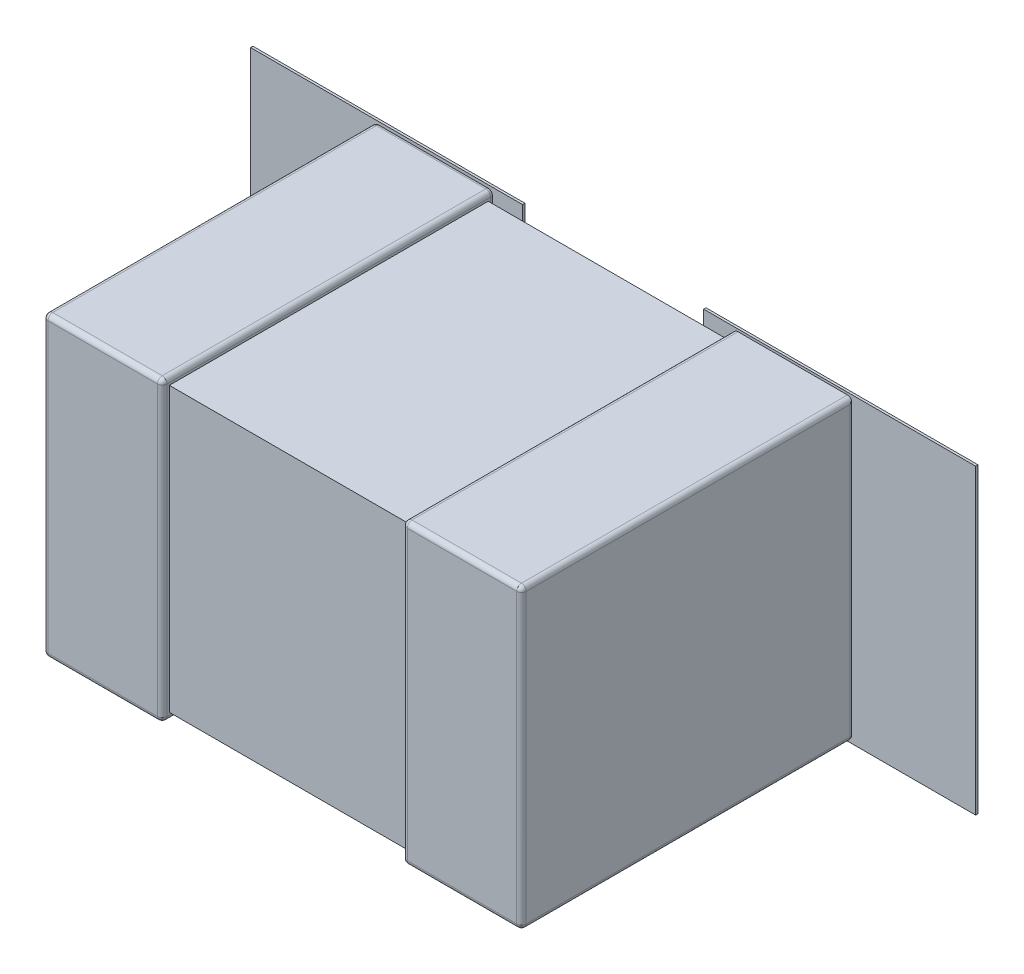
ISO-10303-21;
HEADER;
FILE_DESCRIPTION(('STEP AP214'),'2;1');
FILE_NAME('part.step','',(''),(''),'','','');
FILE_SCHEMA(('AUTOMOTIVE_DESIGN { 1 0 10303 214 1 1 1 1 }'));
ENDSEC;
DATA;
#1=APPLICATION_CONTEXT('core data for automotive mechanical design processes');
#2=APPLICATION_PROTOCOL_DEFINITION('international standard','automotive_design',2000,#1);
#3=PRODUCT_CONTEXT('',#1,'mechanical');
#4=PRODUCT('Part','Part','',(#3));
#5=PRODUCT_RELATED_PRODUCT_CATEGORY('part','',(#4));
#6=PRODUCT_DEFINITION_FORMATION('','',#4);
#7=PRODUCT_DEFINITION_CONTEXT('part definition',#1,'design');
#8=PRODUCT_DEFINITION('design','',#6,#7);
#9=PRODUCT_DEFINITION_SHAPE('','',#8);
#10=(LENGTH_UNIT() NAMED_UNIT(*) SI_UNIT(.MILLI.,.METRE.));
#11=(NAMED_UNIT(*) PLANE_ANGLE_UNIT() SI_UNIT($,.RADIAN.));
#12=(NAMED_UNIT(*) SI_UNIT($,.STERADIAN.) SOLID_ANGLE_UNIT());
#13=UNCERTAINTY_MEASURE_WITH_UNIT(LENGTH_MEASURE(1.E-05),#10,'distance_accuracy_value','');
#14=(GEOMETRIC_REPRESENTATION_CONTEXT(3) GLOBAL_UNCERTAINTY_ASSIGNED_CONTEXT((#13)) GLOBAL_UNIT_ASSIGNED_CONTEXT((#10,
#11,#12)) REPRESENTATION_CONTEXT('',''));
#15=CARTESIAN_POINT('',(0.,0.,0.));
#16=DIRECTION('',(0.,0.,1.));
#17=DIRECTION('',(1.,0.,0.));
#18=AXIS2_PLACEMENT_3D('',#15,#16,#17);
#19=CARTESIAN_POINT('',(0.,0.,0.0762));
#20=DIRECTION('',(0.,0.,1.));
#21=DIRECTION('',(1.,0.,0.));
#22=AXIS2_PLACEMENT_3D('',#19,#20,#21);
#23=PLANE('',#22);
#24=DIRECTION('',(1.,0.,0.));
#25=VECTOR('',#24,1.);
#26=CARTESIAN_POINT('',(-1.5235,-0.635,0.0762));
#27=LINE('',#26,#25);
#28=CARTESIAN_POINT('',(-1.5235,-0.635,0.0762));
#29=VERTEX_POINT('',#28);
#30=CARTESIAN_POINT('',(-0.380500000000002,-0.635,0.0762));
#31=VERTEX_POINT('',#30);
#32=EDGE_CURVE('E917',#29,#31,#27,.T.);
#33=ORIENTED_EDGE('',*,*,#32,.F.);
#34=DIRECTION('',(0.,1.,0.));
#35=VECTOR('',#34,1.);
#36=CARTESIAN_POINT('',(-1.5235,0.635,0.0762));
#37=LINE('',#36,#35);
#38=CARTESIAN_POINT('',(-1.5235,0.635,0.0762));
#39=VERTEX_POINT('',#38);
#40=EDGE_CURVE('E86',#39,#29,#37,.F.);
#41=ORIENTED_EDGE('',*,*,#40,.F.);
#42=DIRECTION('',(1.,0.,0.));
#43=VECTOR('',#42,1.);
#44=CARTESIAN_POINT('',(-0.380500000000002,0.635,0.0762));
#45=LINE('',#44,#43);
#46=CARTESIAN_POINT('',(-0.380500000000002,0.635,0.0762));
#47=VERTEX_POINT('',#46);
#48=EDGE_CURVE('E415',#47,#39,#45,.F.);
#49=ORIENTED_EDGE('',*,*,#48,.F.);
#50=DIRECTION('',(0.,1.,0.));
#51=VECTOR('',#50,1.);
#52=CARTESIAN_POINT('',(-0.380500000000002,-0.635,0.0762));
#53=LINE('',#52,#51);
#54=EDGE_CURVE('E924',#31,#47,#53,.T.);
#55=ORIENTED_EDGE('',*,*,#54,.F.);
#56=EDGE_LOOP('',(#33,#41,#49,#55));
#57=FACE_BOUND('',#56,.T.);
#58=ADVANCED_FACE('F16',(#57),#23,.F.);
#59=CARTESIAN_POINT('',(-0.98495100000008,0.60496700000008,1.45624800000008));
#60=DIRECTION('',(-0.707106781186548,0.,0.707106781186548));
#61=DIRECTION('',(0.,1.,0.));
#62=AXIS2_PLACEMENT_3D('',#59,#60,#61);
#63=SPHERICAL_SURFACE('',#62,0.0199999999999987);
#64=CARTESIAN_POINT('',(-0.98495100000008,0.60496700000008,1.45624800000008));
#65=DIRECTION('',(0.,-1.,0.));
#66=DIRECTION('',(0.,0.,-1.));
#67=AXIS2_PLACEMENT_3D('',#64,#65,#66);
#68=CIRCLE('',#67,0.0199999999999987);
#69=CARTESIAN_POINT('',(-0.98495100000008,0.60496700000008,1.47624800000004));
#70=VERTEX_POINT('',#69);
#71=CARTESIAN_POINT('',(-0.99909313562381,0.60496700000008,1.47039013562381));
#72=VERTEX_POINT('',#71);
#73=EDGE_CURVE('E248',#70,#72,#68,.T.);
#74=ORIENTED_EDGE('',*,*,#73,.F.);
#75=CARTESIAN_POINT('',(-0.98495100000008,0.60496700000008,1.45624800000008));
#76=DIRECTION('',(-1.,0.,0.));
#77=DIRECTION('',(0.,0.,1.));
#78=AXIS2_PLACEMENT_3D('',#75,#76,#77);
#79=CIRCLE('',#78,0.0199999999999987);
#80=CARTESIAN_POINT('',(-0.98495100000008,0.624967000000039,1.45624800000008));
#81=VERTEX_POINT('',#80);
#82=EDGE_CURVE('E251',#81,#70,#79,.F.);
#83=ORIENTED_EDGE('',*,*,#82,.F.);
#84=CARTESIAN_POINT('',(-0.98495100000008,0.60496700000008,1.45624800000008));
#85=DIRECTION('',(0.,0.,-1.));
#86=DIRECTION('',(-1.,0.,0.));
#87=AXIS2_PLACEMENT_3D('',#84,#85,#86);
#88=CIRCLE('',#87,0.0199999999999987);
#89=CARTESIAN_POINT('',(-1.00495100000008,0.60496700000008,1.45624800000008));
#90=VERTEX_POINT('',#89);
#91=EDGE_CURVE('E19',#90,#81,#88,.T.);
#92=ORIENTED_EDGE('',*,*,#91,.F.);
#93=CARTESIAN_POINT('',(-0.98495100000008,0.60496700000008,1.45624800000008));
#94=DIRECTION('',(0.,-1.,0.));
#95=DIRECTION('',(0.,0.,-1.));
#96=AXIS2_PLACEMENT_3D('',#93,#94,#95);
#97=CIRCLE('',#96,0.0199999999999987);
#98=EDGE_CURVE('E253',#72,#90,#97,.T.);
#99=ORIENTED_EDGE('',*,*,#98,.F.);
#100=EDGE_LOOP('',(#74,#83,#92,#99));
#101=FACE_BOUND('',#100,.T.);
#102=ADVANCED_FACE('F250',(#101),#63,.T.);
#103=CARTESIAN_POINT('',(-1.004951,0.624967,0.0762));
#104=DIRECTION('',(-1.,0.,0.));
#105=DIRECTION('',(0.,0.,1.));
#106=AXIS2_PLACEMENT_3D('',#103,#104,#105);
#107=PLANE('',#106);
#108=DIRECTION('',(0.,1.,0.));
#109=VECTOR('',#108,1.);
#110=CARTESIAN_POINT('',(-1.00495100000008,-2.43846719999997,0.0961999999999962));
#111=LINE('',#110,#109);
#112=CARTESIAN_POINT('',(-1.00495100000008,-0.60496700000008,0.0961999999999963));
#113=VERTEX_POINT('',#112);
#114=CARTESIAN_POINT('',(-1.00495100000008,0.60496700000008,0.0961999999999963));
#115=VERTEX_POINT('',#114);
#116=EDGE_CURVE('E414',#113,#115,#111,.T.);
#117=ORIENTED_EDGE('',*,*,#116,.F.);
#118=DIRECTION('',(0.,0.,-1.));
#119=VECTOR('',#118,1.);
#120=CARTESIAN_POINT('',(-1.00495100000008,-0.60496700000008,3.3013505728));
#121=LINE('',#120,#119);
#122=CARTESIAN_POINT('',(-1.00495100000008,-0.60496700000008,1.45624800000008));
#123=VERTEX_POINT('',#122);
#124=EDGE_CURVE('E457',#123,#113,#121,.T.);
#125=ORIENTED_EDGE('',*,*,#124,.F.);
#126=DIRECTION('',(0.,-1.,0.));
#127=VECTOR('',#126,1.);
#128=CARTESIAN_POINT('',(-1.00495100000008,2.43846719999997,1.45624800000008));
#129=LINE('',#128,#127);
#130=EDGE_CURVE('E453',#90,#123,#129,.T.);
#131=ORIENTED_EDGE('',*,*,#130,.F.);
#132=DIRECTION('',(0.,0.,-1.));
#133=VECTOR('',#132,1.);
#134=CARTESIAN_POINT('',(-1.00495100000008,0.60496700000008,3.3013505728));
#135=LINE('',#134,#133);
#136=EDGE_CURVE('E765',#115,#90,#135,.F.);
#137=ORIENTED_EDGE('',*,*,#136,.F.);
#138=EDGE_LOOP('',(#117,#125,#131,#137));
#139=FACE_BOUND('',#138,.T.);
#140=ADVANCED_FACE('F447',(#139),#107,.T.);
#141=CARTESIAN_POINT('',(-0.98495100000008,-0.60496700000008,1.45624800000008));
#142=DIRECTION('',(-0.707106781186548,-0.707106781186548,0.));
#143=DIRECTION('',(0.,0.,1.));
#144=AXIS2_PLACEMENT_3D('',#141,#142,#143);
#145=SPHERICAL_SURFACE('',#144,0.0199999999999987);
#146=CARTESIAN_POINT('',(-0.98495100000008,-0.60496700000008,1.45624800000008));
#147=DIRECTION('',(0.,0.,-1.));
#148=DIRECTION('',(-1.,0.,0.));
#149=AXIS2_PLACEMENT_3D('',#146,#147,#148);
#150=CIRCLE('',#149,0.0199999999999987);
#151=CARTESIAN_POINT('',(-0.99909313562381,-0.61910913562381,1.45624800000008));
#152=VERTEX_POINT('',#151);
#153=EDGE_CURVE('E34',#152,#123,#150,.T.);
#154=ORIENTED_EDGE('',*,*,#153,.F.);
#155=CARTESIAN_POINT('',(-0.98495100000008,-0.60496700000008,1.45624800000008));
#156=DIRECTION('',(0.,0.,-1.));
#157=DIRECTION('',(-1.,0.,0.));
#158=AXIS2_PLACEMENT_3D('',#155,#156,#157);
#159=CIRCLE('',#158,0.0199999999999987);
#160=CARTESIAN_POINT('',(-0.98495100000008,-0.624967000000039,1.45624800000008));
#161=VERTEX_POINT('',#160);
#162=EDGE_CURVE('E405',#161,#152,#159,.T.);
#163=ORIENTED_EDGE('',*,*,#162,.F.);
#164=CARTESIAN_POINT('',(-0.98495100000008,-0.60496700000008,1.45624800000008));
#165=DIRECTION('',(1.,0.,0.));
#166=DIRECTION('',(0.,0.,-1.));
#167=AXIS2_PLACEMENT_3D('',#164,#165,#166);
#168=CIRCLE('',#167,0.0199999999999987);
#169=CARTESIAN_POINT('',(-0.98495100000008,-0.60496700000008,1.47624800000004));
#170=VERTEX_POINT('',#169);
#171=EDGE_CURVE('E674',#170,#161,#168,.T.);
#172=ORIENTED_EDGE('',*,*,#171,.F.);
#173=CARTESIAN_POINT('',(-0.98495100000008,-0.60496700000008,1.45624800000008));
#174=DIRECTION('',(0.,-1.,0.));
#175=DIRECTION('',(0.,0.,-1.));
#176=AXIS2_PLACEMENT_3D('',#173,#174,#175);
#177=CIRCLE('',#176,0.0199999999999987);
#178=EDGE_CURVE('E271',#123,#170,#177,.F.);
#179=ORIENTED_EDGE('',*,*,#178,.F.);
#180=EDGE_LOOP('',(#154,#163,#172,#179));
#181=FACE_BOUND('',#180,.T.);
#182=ADVANCED_FACE('F442',(#181),#145,.T.);
#183=CARTESIAN_POINT('',(-0.98495100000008,0.60496700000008,3.3013505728));
#184=DIRECTION('',(0.,0.,-1.));
#185=DIRECTION('',(-1.,0.,0.));
#186=AXIS2_PLACEMENT_3D('',#183,#184,#185);
#187=CYLINDRICAL_SURFACE('',#186,0.0199999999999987);
#188=ORIENTED_EDGE('',*,*,#91,.T.);
#189=DIRECTION('',(0.,0.,1.));
#190=VECTOR('',#189,1.);
#191=CARTESIAN_POINT('',(-0.98495100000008,0.624967,0.0762));
#192=LINE('',#191,#190);
#193=CARTESIAN_POINT('',(-0.98495100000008,0.624967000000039,0.096199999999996));
#194=VERTEX_POINT('',#193);
#195=EDGE_CURVE('E451',#194,#81,#192,.T.);
#196=ORIENTED_EDGE('',*,*,#195,.F.);
#197=CARTESIAN_POINT('',(-0.98495100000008,0.60496700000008,0.0961999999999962));
#198=DIRECTION('',(0.,0.,-1.));
#199=DIRECTION('',(-0.707106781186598,0.707106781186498,0.));
#200=AXIS2_PLACEMENT_3D('',#197,#198,#199);
#201=CIRCLE('',#200,0.0199999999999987);
#202=CARTESIAN_POINT('',(-0.999093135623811,0.619109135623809,0.0961999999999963));
#203=VERTEX_POINT('',#202);
#204=EDGE_CURVE('E407',#203,#194,#201,.T.);
#205=ORIENTED_EDGE('',*,*,#204,.F.);
#206=CARTESIAN_POINT('',(-0.98495100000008,0.60496700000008,0.0961999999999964));
#207=DIRECTION('',(0.,0.,-1.));
#208=DIRECTION('',(-1.,0.,0.));
#209=AXIS2_PLACEMENT_3D('',#206,#207,#208);
#210=CIRCLE('',#209,0.0199999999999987);
#211=EDGE_CURVE('E410',#115,#203,#210,.T.);
#212=ORIENTED_EDGE('',*,*,#211,.F.);
#213=ORIENTED_EDGE('',*,*,#136,.T.);
#214=EDGE_LOOP('',(#188,#196,#205,#212,#213));
#215=FACE_BOUND('',#214,.T.);
#216=ADVANCED_FACE('F439',(#215),#187,.T.);
#217=CARTESIAN_POINT('',(-1.5235,0.635,0.0762));
#218=DIRECTION('',(-1.,0.,0.));
#219=DIRECTION('',(0.,0.,1.));
#220=AXIS2_PLACEMENT_3D('',#217,#218,#219);
#221=PLANE('',#220);
#222=DIRECTION('',(0.,0.,1.));
#223=VECTOR('',#222,1.);
#224=CARTESIAN_POINT('',(-1.5235,0.635,0.0762));
#225=LINE('',#224,#223);
#226=CARTESIAN_POINT('',(-1.5235,0.635,0.0862000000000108));
#227=VERTEX_POINT('',#226);
#228=EDGE_CURVE('E921',#39,#227,#225,.T.);
#229=ORIENTED_EDGE('',*,*,#228,.F.);
#230=ORIENTED_EDGE('',*,*,#40,.T.);
#231=DIRECTION('',(0.,0.,-1.));
#232=VECTOR('',#231,1.);
#233=CARTESIAN_POINT('',(-1.5235,-0.635,0.0762));
#234=LINE('',#233,#232);
#235=CARTESIAN_POINT('',(-1.5235,-0.635,0.0862000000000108));
#236=VERTEX_POINT('',#235);
#237=EDGE_CURVE('E919',#236,#29,#234,.T.);
#238=ORIENTED_EDGE('',*,*,#237,.F.);
#239=DIRECTION('',(0.,1.,0.));
#240=VECTOR('',#239,1.);
#241=CARTESIAN_POINT('',(-1.5235,0.,0.0862000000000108));
#242=LINE('',#241,#240);
#243=EDGE_CURVE('E350',#227,#236,#242,.F.);
#244=ORIENTED_EDGE('',*,*,#243,.F.);
#245=EDGE_LOOP('',(#229,#230,#238,#244));
#246=FACE_BOUND('',#245,.T.);
#247=ADVANCED_FACE('F435',(#246),#221,.T.);
#248=CARTESIAN_POINT('',(-1.5235,-0.635,0.0762));
#249=DIRECTION('',(0.,-1.,0.));
#250=DIRECTION('',(0.,0.,-1.));
#251=AXIS2_PLACEMENT_3D('',#248,#249,#250);
#252=PLANE('',#251);
#253=ORIENTED_EDGE('',*,*,#237,.T.);
#254=ORIENTED_EDGE('',*,*,#32,.T.);
#255=DIRECTION('',(0.,0.,-1.));
#256=VECTOR('',#255,1.);
#257=CARTESIAN_POINT('',(-0.380500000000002,-0.635,0.0762));
#258=LINE('',#257,#256);
#259=CARTESIAN_POINT('',(-0.380500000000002,-0.635,0.0862000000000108));
#260=VERTEX_POINT('',#259);
#261=EDGE_CURVE('E928',#260,#31,#258,.T.);
#262=ORIENTED_EDGE('',*,*,#261,.F.);
#263=DIRECTION('',(1.,0.,0.));
#264=VECTOR('',#263,1.);
#265=CARTESIAN_POINT('',(0.,-0.635,0.0862000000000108));
#266=LINE('',#265,#264);
#267=EDGE_CURVE('E347',#236,#260,#266,.T.);
#268=ORIENTED_EDGE('',*,*,#267,.F.);
#269=EDGE_LOOP('',(#253,#254,#262,#268));
#270=FACE_BOUND('',#269,.T.);
#271=ADVANCED_FACE('F431',(#270),#252,.T.);
#272=CARTESIAN_POINT('',(-0.380500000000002,-0.635,0.0762));
#273=DIRECTION('',(1.,0.,0.));
#274=DIRECTION('',(0.,0.,-1.));
#275=AXIS2_PLACEMENT_3D('',#272,#273,#274);
#276=PLANE('',#275);
#277=ORIENTED_EDGE('',*,*,#261,.T.);
#278=ORIENTED_EDGE('',*,*,#54,.T.);
#279=DIRECTION('',(0.,0.,1.));
#280=VECTOR('',#279,1.);
#281=CARTESIAN_POINT('',(-0.380500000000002,0.635,0.0762));
#282=LINE('',#281,#280);
#283=CARTESIAN_POINT('',(-0.380500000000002,0.635,0.0862000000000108));
#284=VERTEX_POINT('',#283);
#285=EDGE_CURVE('E923',#284,#47,#282,.F.);
#286=ORIENTED_EDGE('',*,*,#285,.F.);
#287=DIRECTION('',(0.,1.,0.));
#288=VECTOR('',#287,1.);
#289=CARTESIAN_POINT('',(-0.380500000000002,0.,0.0862000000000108));
#290=LINE('',#289,#288);
#291=EDGE_CURVE('E344',#260,#284,#290,.T.);
#292=ORIENTED_EDGE('',*,*,#291,.F.);
#293=EDGE_LOOP('',(#277,#278,#286,#292));
#294=FACE_BOUND('',#293,.T.);
#295=ADVANCED_FACE('F427',(#294),#276,.T.);
#296=CARTESIAN_POINT('',(-0.380500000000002,0.635,0.0762));
#297=DIRECTION('',(0.,1.,0.));
#298=DIRECTION('',(0.,0.,1.));
#299=AXIS2_PLACEMENT_3D('',#296,#297,#298);
#300=PLANE('',#299);
#301=ORIENTED_EDGE('',*,*,#285,.T.);
#302=ORIENTED_EDGE('',*,*,#48,.T.);
#303=ORIENTED_EDGE('',*,*,#228,.T.);
#304=DIRECTION('',(1.,0.,0.));
#305=VECTOR('',#304,1.);
#306=CARTESIAN_POINT('',(0.,0.635,0.0862000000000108));
#307=LINE('',#306,#305);
#308=EDGE_CURVE('E341',#284,#227,#307,.F.);
#309=ORIENTED_EDGE('',*,*,#308,.F.);
#310=EDGE_LOOP('',(#301,#302,#303,#309));
#311=FACE_BOUND('',#310,.T.);
#312=ADVANCED_FACE('F423',(#311),#300,.T.);
#313=CARTESIAN_POINT('',(-0.98495100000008,-0.60496700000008,0.0961999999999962));
#314=DIRECTION('',(-0.707106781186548,0.,-0.707106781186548));
#315=DIRECTION('',(0.,-1.,0.));
#316=AXIS2_PLACEMENT_3D('',#313,#314,#315);
#317=SPHERICAL_SURFACE('',#316,0.0199999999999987);
#318=CARTESIAN_POINT('',(-0.98495100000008,-0.60496700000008,0.0961999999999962));
#319=DIRECTION('',(0.,1.,0.));
#320=DIRECTION('',(0.,0.,1.));
#321=AXIS2_PLACEMENT_3D('',#318,#319,#320);
#322=CIRCLE('',#321,0.0199999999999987);
#323=CARTESIAN_POINT('',(-1.00227150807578,-0.60496700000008,0.0862000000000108));
#324=VERTEX_POINT('',#323);
#325=EDGE_CURVE('E411',#324,#113,#322,.T.);
#326=ORIENTED_EDGE('',*,*,#325,.F.);
#327=CARTESIAN_POINT('',(-0.98495100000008,-0.622287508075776,0.0862000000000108));
#328=CARTESIAN_POINT('',(-0.986903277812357,-0.622300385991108,0.0862000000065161));
#329=CARTESIAN_POINT('',(-0.988847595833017,-0.621959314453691,0.0862000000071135));
#330=CARTESIAN_POINT('',(-0.992520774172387,-0.620662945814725,0.0862000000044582));
#331=CARTESIAN_POINT('',(-0.994249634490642,-0.619707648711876,0.0862000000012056));
#332=CARTESIAN_POINT('',(-0.997292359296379,-0.617276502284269,0.086199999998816));
#333=CARTESIAN_POINT('',(-0.998606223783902,-0.615800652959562,0.0861999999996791));
#334=CARTESIAN_POINT('',(-1.00066964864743,-0.612495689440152,0.0862000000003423));
#335=CARTESIAN_POINT('',(-1.00141920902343,-0.610666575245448,0.0862000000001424));
#336=CARTESIAN_POINT('',(-1.00213177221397,-0.607521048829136,0.0861999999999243));
#337=CARTESIAN_POINT('',(-1.00227616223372,-0.606243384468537,0.0861999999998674));
#338=CARTESIAN_POINT('',(-1.00227150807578,-0.60496700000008,0.0862000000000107));
#339=B_SPLINE_CURVE_WITH_KNOTS('',3,(#327,#328,#329,#330,#331,#332,#333,#334,#335,#336,#337,
#338),.UNSPECIFIED.,.F.,.F.,(4,2,2,2,2,4),(0.,0.00581573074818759,0.0116314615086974,
0.0174471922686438,0.0232629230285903,0.0270884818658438),.UNSPECIFIED.);
#340=CARTESIAN_POINT('',(-0.98495100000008,-0.62228750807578,0.0862000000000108));
#341=VERTEX_POINT('',#340);
#342=EDGE_CURVE('E337',#341,#324,#339,.T.);
#343=ORIENTED_EDGE('',*,*,#342,.F.);
#344=CARTESIAN_POINT('',(-0.98495100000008,-0.60496700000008,0.0961999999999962));
#345=DIRECTION('',(-1.,0.,0.));
#346=DIRECTION('',(0.,0.,1.));
#347=AXIS2_PLACEMENT_3D('',#344,#345,#346);
#348=CIRCLE('',#347,0.0199999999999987);
#349=CARTESIAN_POINT('',(-0.98495100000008,-0.624967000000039,0.0961999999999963));
#350=VERTEX_POINT('',#349);
#351=EDGE_CURVE('E264',#350,#341,#348,.F.);
#352=ORIENTED_EDGE('',*,*,#351,.F.);
#353=CARTESIAN_POINT('',(-0.98495100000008,-0.60496700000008,0.0961999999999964));
#354=DIRECTION('',(0.,0.,-1.));
#355=DIRECTION('',(-1.,0.,0.));
#356=AXIS2_PLACEMENT_3D('',#353,#354,#355);
#357=CIRCLE('',#356,0.0199999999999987);
#358=EDGE_CURVE('E745',#113,#350,#357,.F.);
#359=ORIENTED_EDGE('',*,*,#358,.F.);
#360=EDGE_LOOP('',(#326,#343,#352,#359));
#361=FACE_BOUND('',#360,.T.);
#362=ADVANCED_FACE('F419',(#361),#317,.T.);
#363=CARTESIAN_POINT('',(-0.98495100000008,-2.43846719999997,0.0961999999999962));
#364=DIRECTION('',(0.,1.,0.));
#365=DIRECTION('',(0.,0.,1.));
#366=AXIS2_PLACEMENT_3D('',#363,#364,#365);
#367=CYLINDRICAL_SURFACE('',#366,0.0199999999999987);
#368=CARTESIAN_POINT('',(-0.98495100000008,0.60496700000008,0.0961999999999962));
#369=DIRECTION('',(0.,1.,0.));
#370=DIRECTION('',(0.,0.,1.));
#371=AXIS2_PLACEMENT_3D('',#368,#369,#370);
#372=CIRCLE('',#371,0.0199999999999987);
#373=CARTESIAN_POINT('',(-1.00227150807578,0.60496700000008,0.0862000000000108));
#374=VERTEX_POINT('',#373);
#375=EDGE_CURVE('E757',#374,#115,#372,.T.);
#376=ORIENTED_EDGE('',*,*,#375,.F.);
#377=DIRECTION('',(0.,1.,0.));
#378=VECTOR('',#377,1.);
#379=CARTESIAN_POINT('',(-1.00227150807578,0.,0.0862000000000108));
#380=LINE('',#379,#378);
#381=EDGE_CURVE('E334',#324,#374,#380,.T.);
#382=ORIENTED_EDGE('',*,*,#381,.F.);
#383=ORIENTED_EDGE('',*,*,#325,.T.);
#384=ORIENTED_EDGE('',*,*,#116,.T.);
#385=EDGE_LOOP('',(#376,#382,#383,#384));
#386=FACE_BOUND('',#385,.T.);
#387=ADVANCED_FACE('F399',(#386),#367,.T.);
#388=CARTESIAN_POINT('',(-0.98495100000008,0.60496700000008,0.0961999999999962));
#389=DIRECTION('',(-0.707106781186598,0.707106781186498,0.));
#390=DIRECTION('',(0.,0.,-1.));
#391=AXIS2_PLACEMENT_3D('',#388,#389,#390);
#392=SPHERICAL_SURFACE('',#391,0.0199999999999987);
#393=CARTESIAN_POINT('',(-0.98495100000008,0.60496700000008,0.0961999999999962));
#394=DIRECTION('',(1.,0.,0.));
#395=DIRECTION('',(0.,0.,-1.));
#396=AXIS2_PLACEMENT_3D('',#393,#394,#395);
#397=CIRCLE('',#396,0.0199999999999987);
#398=CARTESIAN_POINT('',(-0.98495100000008,0.62228750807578,0.0862000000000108));
#399=VERTEX_POINT('',#398);
#400=EDGE_CURVE('E409',#399,#194,#397,.T.);
#401=ORIENTED_EDGE('',*,*,#400,.F.);
#402=CARTESIAN_POINT('',(-1.00227150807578,0.60496700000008,0.0862000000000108));
#403=CARTESIAN_POINT('',(-1.00228438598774,0.60691927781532,0.0862000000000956));
#404=CARTESIAN_POINT('',(-1.00194331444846,0.608863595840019,0.0862000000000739));
#405=CARTESIAN_POINT('',(-1.00064694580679,0.612536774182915,0.0862000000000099));
#406=CARTESIAN_POINT('',(-0.999691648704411,0.614265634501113,0.0861999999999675));
#407=CARTESIAN_POINT('',(-0.99726050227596,0.617308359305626,0.0862000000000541));
#408=CARTESIAN_POINT('',(-0.995784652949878,0.618622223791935,0.086200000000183));
#409=CARTESIAN_POINT('',(-0.992479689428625,0.620685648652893,0.0862000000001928));
#410=CARTESIAN_POINT('',(-0.990650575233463,0.621435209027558,0.0862000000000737));
#411=CARTESIAN_POINT('',(-0.987505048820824,0.622147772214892,0.0861999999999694));
#412=CARTESIAN_POINT('',(-0.986227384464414,0.622292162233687,0.0861999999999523));
#413=CARTESIAN_POINT('',(-0.98495100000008,0.622287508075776,0.0862000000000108));
#414=B_SPLINE_CURVE_WITH_KNOTS('',3,(#402,#403,#404,#405,#406,#407,#408,#409,#410,#411,#412,
#413),.UNSPECIFIED.,.F.,.F.,(4,2,2,2,2,4),(0.,0.00581573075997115,0.0116314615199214,
0.0174471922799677,0.0232629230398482,0.0270884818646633),.UNSPECIFIED.);
#415=EDGE_CURVE('E333',#374,#399,#414,.T.);
#416=ORIENTED_EDGE('',*,*,#415,.F.);
#417=ORIENTED_EDGE('',*,*,#375,.T.);
#418=ORIENTED_EDGE('',*,*,#211,.T.);
#419=ORIENTED_EDGE('',*,*,#204,.T.);
#420=EDGE_LOOP('',(#401,#416,#417,#418,#419));
#421=FACE_BOUND('',#420,.T.);
#422=ADVANCED_FACE('F392',(#421),#392,.T.);
#423=CARTESIAN_POINT('',(-5.4955692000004,0.60496700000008,0.0961999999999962));
#424=DIRECTION('',(1.,0.,0.));
#425=DIRECTION('',(0.,0.,-1.));
#426=AXIS2_PLACEMENT_3D('',#423,#424,#425);
#427=CYLINDRICAL_SURFACE('',#426,0.0199999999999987);
#428=CARTESIAN_POINT('',(-0.524950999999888,0.60496700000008,0.0961999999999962));
#429=DIRECTION('',(1.,0.,0.));
#430=DIRECTION('',(0.,0.,-1.));
#431=AXIS2_PLACEMENT_3D('',#428,#429,#430);
#432=CIRCLE('',#431,0.0199999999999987);
#433=CARTESIAN_POINT('',(-0.524950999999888,0.62228750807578,0.0862000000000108));
#434=VERTEX_POINT('',#433);
#435=CARTESIAN_POINT('',(-0.524950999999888,0.624967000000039,0.0961999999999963));
#436=VERTEX_POINT('',#435);
#437=EDGE_CURVE('E353',#434,#436,#432,.T.);
#438=ORIENTED_EDGE('',*,*,#437,.F.);
#439=DIRECTION('',(1.,0.,0.));
#440=VECTOR('',#439,1.);
#441=CARTESIAN_POINT('',(0.,0.622287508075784,0.0862000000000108));
#442=LINE('',#441,#440);
#443=EDGE_CURVE('E329',#399,#434,#442,.T.);
#444=ORIENTED_EDGE('',*,*,#443,.F.);
#445=ORIENTED_EDGE('',*,*,#400,.T.);
#446=DIRECTION('',(1.,0.,0.));
#447=VECTOR('',#446,1.);
#448=CARTESIAN_POINT('',(1.004951,0.624967,0.0961999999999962));
#449=LINE('',#448,#447);
#450=EDGE_CURVE('E673',#436,#194,#449,.F.);
#451=ORIENTED_EDGE('',*,*,#450,.F.);
#452=EDGE_LOOP('',(#438,#444,#445,#451));
#453=FACE_BOUND('',#452,.T.);
#454=ADVANCED_FACE('F398',(#453),#427,.T.);
#455=CARTESIAN_POINT('',(-0.98495100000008,-0.60496700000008,3.3013505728));
#456=DIRECTION('',(0.,0.,-1.));
#457=DIRECTION('',(-1.,0.,0.));
#458=AXIS2_PLACEMENT_3D('',#455,#456,#457);
#459=CYLINDRICAL_SURFACE('',#458,0.0199999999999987);
#460=ORIENTED_EDGE('',*,*,#153,.T.);
#461=ORIENTED_EDGE('',*,*,#124,.T.);
#462=ORIENTED_EDGE('',*,*,#358,.T.);
#463=DIRECTION('',(0.,0.,-1.));
#464=VECTOR('',#463,1.);
#465=CARTESIAN_POINT('',(-0.98495100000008,-0.624967,0.0762));
#466=LINE('',#465,#464);
#467=EDGE_CURVE('E323',#161,#350,#466,.T.);
#468=ORIENTED_EDGE('',*,*,#467,.F.);
#469=ORIENTED_EDGE('',*,*,#162,.T.);
#470=EDGE_LOOP('',(#460,#461,#462,#468,#469));
#471=FACE_BOUND('',#470,.T.);
#472=ADVANCED_FACE('F742',(#471),#459,.T.);
#473=CARTESIAN_POINT('',(5.4955692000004,-0.60496700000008,0.0961999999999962));
#474=DIRECTION('',(-1.,0.,0.));
#475=DIRECTION('',(0.,0.,1.));
#476=AXIS2_PLACEMENT_3D('',#473,#474,#475);
#477=CYLINDRICAL_SURFACE('',#476,0.0199999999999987);
#478=ORIENTED_EDGE('',*,*,#351,.T.);
#479=DIRECTION('',(1.,0.,0.));
#480=VECTOR('',#479,1.);
#481=CARTESIAN_POINT('',(0.,-0.622287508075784,0.0862000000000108));
#482=LINE('',#481,#480);
#483=CARTESIAN_POINT('',(-0.524950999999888,-0.62228750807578,0.0862000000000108));
#484=VERTEX_POINT('',#483);
#485=EDGE_CURVE('E338',#484,#341,#482,.F.);
#486=ORIENTED_EDGE('',*,*,#485,.F.);
#487=CARTESIAN_POINT('',(-0.524950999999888,-0.60496700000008,0.0961999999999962));
#488=DIRECTION('',(-1.,0.,0.));
#489=DIRECTION('',(0.,0.,1.));
#490=AXIS2_PLACEMENT_3D('',#487,#488,#489);
#491=CIRCLE('',#490,0.0199999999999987);
#492=CARTESIAN_POINT('',(-0.524950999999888,-0.624967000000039,0.0961999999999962));
#493=VERTEX_POINT('',#492);
#494=EDGE_CURVE('E380',#493,#484,#491,.F.);
#495=ORIENTED_EDGE('',*,*,#494,.F.);
#496=DIRECTION('',(1.,0.,0.));
#497=VECTOR('',#496,1.);
#498=CARTESIAN_POINT('',(-1.004951,-0.624967,0.0961999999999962));
#499=LINE('',#498,#497);
#500=EDGE_CURVE('E320',#350,#493,#499,.T.);
#501=ORIENTED_EDGE('',*,*,#500,.F.);
#502=EDGE_LOOP('',(#478,#486,#495,#501));
#503=FACE_BOUND('',#502,.T.);
#504=ADVANCED_FACE('F697',(#503),#477,.T.);
#505=CARTESIAN_POINT('',(5.4955692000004,0.60496700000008,1.45624800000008));
#506=DIRECTION('',(-1.,0.,0.));
#507=DIRECTION('',(0.,0.,1.));
#508=AXIS2_PLACEMENT_3D('',#505,#506,#507);
#509=CYLINDRICAL_SURFACE('',#508,0.0199999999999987);
#510=ORIENTED_EDGE('',*,*,#82,.T.);
#511=DIRECTION('',(1.,0.,0.));
#512=VECTOR('',#511,1.);
#513=CARTESIAN_POINT('',(0.,0.60496700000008,1.476248));
#514=LINE('',#513,#512);
#515=CARTESIAN_POINT('',(-0.524950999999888,0.60496700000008,1.47624800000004));
#516=VERTEX_POINT('',#515);
#517=EDGE_CURVE('E260',#516,#70,#514,.F.);
#518=ORIENTED_EDGE('',*,*,#517,.F.);
#519=CARTESIAN_POINT('',(-0.524950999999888,0.60496700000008,1.45624800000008));
#520=DIRECTION('',(-1.,0.,0.));
#521=DIRECTION('',(0.,0.,1.));
#522=AXIS2_PLACEMENT_3D('',#519,#520,#521);
#523=CIRCLE('',#522,0.0199999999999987);
#524=CARTESIAN_POINT('',(-0.524950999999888,0.624967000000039,1.45624800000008));
#525=VERTEX_POINT('',#524);
#526=EDGE_CURVE('E282',#525,#516,#523,.F.);
#527=ORIENTED_EDGE('',*,*,#526,.F.);
#528=DIRECTION('',(1.,0.,0.));
#529=VECTOR('',#528,1.);
#530=CARTESIAN_POINT('',(1.004951,0.624967,1.45624800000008));
#531=LINE('',#530,#529);
#532=EDGE_CURVE('E263',#81,#525,#531,.T.);
#533=ORIENTED_EDGE('',*,*,#532,.F.);
#534=EDGE_LOOP('',(#510,#518,#527,#533));
#535=FACE_BOUND('',#534,.T.);
#536=ADVANCED_FACE('F258',(#535),#509,.T.);
#537=CARTESIAN_POINT('',(-0.98495100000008,2.43846719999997,1.45624800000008));
#538=DIRECTION('',(0.,-1.,0.));
#539=DIRECTION('',(0.,0.,-1.));
#540=AXIS2_PLACEMENT_3D('',#537,#538,#539);
#541=CYLINDRICAL_SURFACE('',#540,0.0199999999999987);
#542=ORIENTED_EDGE('',*,*,#178,.T.);
#543=DIRECTION('',(0.,1.,0.));
#544=VECTOR('',#543,1.);
#545=CARTESIAN_POINT('',(-0.98495100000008,0.,1.476248));
#546=LINE('',#545,#544);
#547=EDGE_CURVE('E268',#70,#170,#546,.F.);
#548=ORIENTED_EDGE('',*,*,#547,.F.);
#549=ORIENTED_EDGE('',*,*,#73,.T.);
#550=ORIENTED_EDGE('',*,*,#98,.T.);
#551=ORIENTED_EDGE('',*,*,#130,.T.);
#552=EDGE_LOOP('',(#542,#548,#549,#550,#551));
#553=FACE_BOUND('',#552,.T.);
#554=ADVANCED_FACE('F269',(#553),#541,.T.);
#555=CARTESIAN_POINT('',(-5.4955692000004,-0.60496700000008,1.45624800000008));
#556=DIRECTION('',(1.,0.,0.));
#557=DIRECTION('',(0.,0.,-1.));
#558=AXIS2_PLACEMENT_3D('',#555,#556,#557);
#559=CYLINDRICAL_SURFACE('',#558,0.0199999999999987);
#560=ORIENTED_EDGE('',*,*,#171,.T.);
#561=DIRECTION('',(1.,0.,0.));
#562=VECTOR('',#561,1.);
#563=CARTESIAN_POINT('',(-1.004951,-0.624967,1.45624800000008));
#564=LINE('',#563,#562);
#565=CARTESIAN_POINT('',(-0.524950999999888,-0.624967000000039,1.45624800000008));
#566=VERTEX_POINT('',#565);
#567=EDGE_CURVE('E318',#566,#161,#564,.F.);
#568=ORIENTED_EDGE('',*,*,#567,.F.);
#569=CARTESIAN_POINT('',(-0.524950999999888,-0.60496700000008,1.45624800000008));
#570=DIRECTION('',(1.,0.,0.));
#571=DIRECTION('',(0.,0.,-1.));
#572=AXIS2_PLACEMENT_3D('',#569,#570,#571);
#573=CIRCLE('',#572,0.0199999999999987);
#574=CARTESIAN_POINT('',(-0.524950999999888,-0.60496700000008,1.47624800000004));
#575=VERTEX_POINT('',#574);
#576=EDGE_CURVE('E284',#575,#566,#573,.T.);
#577=ORIENTED_EDGE('',*,*,#576,.F.);
#578=DIRECTION('',(1.,0.,0.));
#579=VECTOR('',#578,1.);
#580=CARTESIAN_POINT('',(0.,-0.60496700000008,1.476248));
#581=LINE('',#580,#579);
#582=EDGE_CURVE('E275',#170,#575,#581,.T.);
#583=ORIENTED_EDGE('',*,*,#582,.F.);
#584=EDGE_LOOP('',(#560,#568,#577,#583));
#585=FACE_BOUND('',#584,.T.);
#586=ADVANCED_FACE('F746',(#585),#559,.T.);
#587=CARTESIAN_POINT('',(1.004951,0.624967,0.0762));
#588=DIRECTION('',(0.,1.,0.));
#589=DIRECTION('',(0.,0.,1.));
#590=AXIS2_PLACEMENT_3D('',#587,#588,#589);
#591=PLANE('',#590);
#592=ORIENTED_EDGE('',*,*,#450,.T.);
#593=ORIENTED_EDGE('',*,*,#195,.T.);
#594=ORIENTED_EDGE('',*,*,#532,.T.);
#595=DIRECTION('',(0.,0.,-1.));
#596=VECTOR('',#595,1.);
#597=CARTESIAN_POINT('',(-0.524950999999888,0.624967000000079,3.3013505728));
#598=LINE('',#597,#596);
#599=EDGE_CURVE('E362',#436,#525,#598,.F.);
#600=ORIENTED_EDGE('',*,*,#599,.F.);
#601=EDGE_LOOP('',(#592,#593,#594,#600));
#602=FACE_BOUND('',#601,.T.);
#603=ADVANCED_FACE('F370',(#602),#591,.T.);
#604=CARTESIAN_POINT('',(-0.524950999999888,0.60496700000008,0.0961999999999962));
#605=DIRECTION('',(0.707106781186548,0.,-0.707106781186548));
#606=DIRECTION('',(0.,1.,0.));
#607=AXIS2_PLACEMENT_3D('',#604,#605,#606);
#608=SPHERICAL_SURFACE('',#607,0.0199999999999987);
#609=CARTESIAN_POINT('',(-0.524950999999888,0.60496700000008,0.0961999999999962));
#610=DIRECTION('',(0.,-1.,0.));
#611=DIRECTION('',(0.,0.,-1.));
#612=AXIS2_PLACEMENT_3D('',#609,#610,#611);
#613=CIRCLE('',#612,0.0199999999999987);
#614=CARTESIAN_POINT('',(-0.507630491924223,0.60496700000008,0.0861999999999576));
#615=VERTEX_POINT('',#614);
#616=CARTESIAN_POINT('',(-0.504950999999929,0.60496700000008,0.0961999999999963));
#617=VERTEX_POINT('',#616);
#618=EDGE_CURVE('E359',#615,#617,#613,.T.);
#619=ORIENTED_EDGE('',*,*,#618,.F.);
#620=CARTESIAN_POINT('',(-0.524950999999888,0.622287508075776,0.0862000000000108));
#621=CARTESIAN_POINT('',(-0.522998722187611,0.622300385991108,0.0862000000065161));
#622=CARTESIAN_POINT('',(-0.521054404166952,0.621959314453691,0.0862000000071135));
#623=CARTESIAN_POINT('',(-0.517381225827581,0.620662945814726,0.0862000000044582));
#624=CARTESIAN_POINT('',(-0.515652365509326,0.619707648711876,0.0862000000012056));
#625=CARTESIAN_POINT('',(-0.512609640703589,0.617276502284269,0.086199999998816));
#626=CARTESIAN_POINT('',(-0.511295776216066,0.615800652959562,0.0861999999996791));
#627=CARTESIAN_POINT('',(-0.509232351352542,0.612495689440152,0.0862000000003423));
#628=CARTESIAN_POINT('',(-0.508482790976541,0.610666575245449,0.0862000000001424));
#629=CARTESIAN_POINT('',(-0.507770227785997,0.607521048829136,0.0861999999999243));
#630=CARTESIAN_POINT('',(-0.507625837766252,0.606243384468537,0.0861999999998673));
#631=CARTESIAN_POINT('',(-0.507630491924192,0.60496700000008,0.0862000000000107));
#632=B_SPLINE_CURVE_WITH_KNOTS('',3,(#620,#621,#622,#623,#624,#625,#626,#627,#628,#629,#630,
#631),.UNSPECIFIED.,.F.,.F.,(4,2,2,2,2,4),(0.,0.00581573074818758,0.0116314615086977,
0.0174471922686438,0.0232629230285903,0.027088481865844),.UNSPECIFIED.);
#633=EDGE_CURVE('E332',#434,#615,#632,.T.);
#634=ORIENTED_EDGE('',*,*,#633,.F.);
#635=ORIENTED_EDGE('',*,*,#437,.T.);
#636=CARTESIAN_POINT('',(-0.524950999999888,0.60496700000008,0.0961999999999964));
#637=DIRECTION('',(0.,0.,-1.));
#638=DIRECTION('',(-1.,0.,0.));
#639=AXIS2_PLACEMENT_3D('',#636,#637,#638);
#640=CIRCLE('',#639,0.0199999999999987);
#641=EDGE_CURVE('E677',#617,#436,#640,.F.);
#642=ORIENTED_EDGE('',*,*,#641,.F.);
#643=EDGE_LOOP('',(#619,#634,#635,#642));
#644=FACE_BOUND('',#643,.T.);
#645=ADVANCED_FACE('F366',(#644),#608,.T.);
#646=CARTESIAN_POINT('',(0.,0.,0.0862000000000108));
#647=DIRECTION('',(0.,0.,1.));
#648=DIRECTION('',(1.,0.,0.));
#649=AXIS2_PLACEMENT_3D('',#646,#647,#648);
#650=PLANE('',#649);
#651=ORIENTED_EDGE('',*,*,#633,.T.);
#652=DIRECTION('',(0.,-1.,0.));
#653=VECTOR('',#652,1.);
#654=CARTESIAN_POINT('',(-0.507630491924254,2.43846719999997,0.0861999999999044));
#655=LINE('',#654,#653);
#656=CARTESIAN_POINT('',(-0.507630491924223,-0.60496700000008,0.0861999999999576));
#657=VERTEX_POINT('',#656);
#658=EDGE_CURVE('E354',#657,#615,#655,.F.);
#659=ORIENTED_EDGE('',*,*,#658,.F.);
#660=CARTESIAN_POINT('',(-0.524950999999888,-0.622287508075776,0.0862000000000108));
#661=CARTESIAN_POINT('',(-0.522998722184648,-0.622300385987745,0.08620000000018));
#662=CARTESIAN_POINT('',(-0.521054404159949,-0.621959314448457,0.0862000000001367));
#663=CARTESIAN_POINT('',(-0.517381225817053,-0.620662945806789,0.0862000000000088));
#664=CARTESIAN_POINT('',(-0.515652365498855,-0.619707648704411,0.0861999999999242));
#665=CARTESIAN_POINT('',(-0.512609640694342,-0.61727650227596,0.0862000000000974));
#666=CARTESIAN_POINT('',(-0.511295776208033,-0.615800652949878,0.0862000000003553));
#667=CARTESIAN_POINT('',(-0.509232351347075,-0.612495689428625,0.0862000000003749));
#668=CARTESIAN_POINT('',(-0.50848279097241,-0.610666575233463,0.0862000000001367));
#669=CARTESIAN_POINT('',(-0.507770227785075,-0.607521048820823,0.086199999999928));
#670=CARTESIAN_POINT('',(-0.507625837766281,-0.606243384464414,0.0861999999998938));
#671=CARTESIAN_POINT('',(-0.507630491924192,-0.60496700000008,0.0862000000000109));
#672=B_SPLINE_CURVE_WITH_KNOTS('',3,(#660,#661,#662,#663,#664,#665,#666,#667,#668,#669,#670,
#671),.UNSPECIFIED.,.F.,.F.,(4,2,2,2,2,4),(0.,0.00581573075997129,0.0116314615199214,
0.0174471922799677,0.0232629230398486,0.0270884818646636),.UNSPECIFIED.);
#673=EDGE_CURVE('E684',#484,#657,#672,.T.);
#674=ORIENTED_EDGE('',*,*,#673,.F.);
#675=ORIENTED_EDGE('',*,*,#485,.T.);
#676=ORIENTED_EDGE('',*,*,#342,.T.);
#677=ORIENTED_EDGE('',*,*,#381,.T.);
#678=ORIENTED_EDGE('',*,*,#415,.T.);
#679=ORIENTED_EDGE('',*,*,#443,.T.);
#680=EDGE_LOOP('',(#651,#659,#674,#675,#676,#677,#678,#679));
#681=FACE_BOUND('',#680,.T.);
#682=ORIENTED_EDGE('',*,*,#291,.T.);
#683=ORIENTED_EDGE('',*,*,#308,.T.);
#684=ORIENTED_EDGE('',*,*,#243,.T.);
#685=ORIENTED_EDGE('',*,*,#267,.T.);
#686=EDGE_LOOP('',(#682,#683,#684,#685));
#687=FACE_BOUND('',#686,.T.);
#688=ADVANCED_FACE('F310',(#681,#687),#650,.T.);
#689=CARTESIAN_POINT('',(-0.524950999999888,-0.60496700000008,0.0961999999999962));
#690=DIRECTION('',(0.707106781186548,-0.707106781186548,0.));
#691=DIRECTION('',(0.,0.,-1.));
#692=AXIS2_PLACEMENT_3D('',#689,#690,#691);
#693=SPHERICAL_SURFACE('',#692,0.0199999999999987);
#694=ORIENTED_EDGE('',*,*,#494,.T.);
#695=ORIENTED_EDGE('',*,*,#673,.T.);
#696=CARTESIAN_POINT('',(-0.524950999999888,-0.60496700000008,0.0961999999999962));
#697=DIRECTION('',(0.,-1.,0.));
#698=DIRECTION('',(0.,0.,-1.));
#699=AXIS2_PLACEMENT_3D('',#696,#697,#698);
#700=CIRCLE('',#699,0.0199999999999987);
#701=CARTESIAN_POINT('',(-0.504950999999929,-0.60496700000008,0.0961999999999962));
#702=VERTEX_POINT('',#701);
#703=EDGE_CURVE('E358',#702,#657,#700,.F.);
#704=ORIENTED_EDGE('',*,*,#703,.F.);
#705=CARTESIAN_POINT('',(-0.524950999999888,-0.60496700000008,0.0961999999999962));
#706=DIRECTION('',(0.,0.,1.));
#707=DIRECTION('',(1.,0.,0.));
#708=AXIS2_PLACEMENT_3D('',#705,#706,#707);
#709=CIRCLE('',#708,0.0199999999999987);
#710=CARTESIAN_POINT('',(-0.510808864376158,-0.61910913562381,0.0961999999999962));
#711=VERTEX_POINT('',#710);
#712=EDGE_CURVE('E706',#711,#702,#709,.T.);
#713=ORIENTED_EDGE('',*,*,#712,.F.);
#714=CARTESIAN_POINT('',(-0.524950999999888,-0.60496700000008,0.0961999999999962));
#715=DIRECTION('',(0.,0.,1.));
#716=DIRECTION('',(1.,0.,0.));
#717=AXIS2_PLACEMENT_3D('',#714,#715,#716);
#718=CIRCLE('',#717,0.0199999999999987);
#719=EDGE_CURVE('E357',#493,#711,#718,.T.);
#720=ORIENTED_EDGE('',*,*,#719,.F.);
#721=EDGE_LOOP('',(#694,#695,#704,#713,#720));
#722=FACE_BOUND('',#721,.T.);
#723=ADVANCED_FACE('F304',(#722),#693,.T.);
#724=CARTESIAN_POINT('',(-1.004951,-0.624967,0.0762));
#725=DIRECTION('',(0.,-1.,0.));
#726=DIRECTION('',(0.,0.,-1.));
#727=AXIS2_PLACEMENT_3D('',#724,#725,#726);
#728=PLANE('',#727);
#729=DIRECTION('',(0.,0.,1.));
#730=VECTOR('',#729,1.);
#731=CARTESIAN_POINT('',(-0.524950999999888,-0.624967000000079,-1.7489025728));
#732=LINE('',#731,#730);
#733=EDGE_CURVE('E713',#566,#493,#732,.F.);
#734=ORIENTED_EDGE('',*,*,#733,.F.);
#735=ORIENTED_EDGE('',*,*,#567,.T.);
#736=ORIENTED_EDGE('',*,*,#467,.T.);
#737=ORIENTED_EDGE('',*,*,#500,.T.);
#738=EDGE_LOOP('',(#734,#735,#736,#737));
#739=FACE_BOUND('',#738,.T.);
#740=ADVANCED_FACE('F298',(#739),#728,.T.);
#741=CARTESIAN_POINT('',(-0.524950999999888,-0.60496700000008,1.45624800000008));
#742=DIRECTION('',(0.707106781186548,0.,0.707106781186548));
#743=DIRECTION('',(0.,-1.,0.));
#744=AXIS2_PLACEMENT_3D('',#741,#742,#743);
#745=SPHERICAL_SURFACE('',#744,0.0199999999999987);
#746=CARTESIAN_POINT('',(-0.524950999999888,-0.60496700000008,1.45624800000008));
#747=DIRECTION('',(0.,1.,0.));
#748=DIRECTION('',(0.,0.,1.));
#749=AXIS2_PLACEMENT_3D('',#746,#747,#748);
#750=CIRCLE('',#749,0.0199999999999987);
#751=CARTESIAN_POINT('',(-0.510808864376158,-0.60496700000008,1.47039013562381));
#752=VERTEX_POINT('',#751);
#753=CARTESIAN_POINT('',(-0.504950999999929,-0.60496700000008,1.45624800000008));
#754=VERTEX_POINT('',#753);
#755=EDGE_CURVE('E726',#752,#754,#750,.T.);
#756=ORIENTED_EDGE('',*,*,#755,.F.);
#757=CARTESIAN_POINT('',(-0.524950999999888,-0.60496700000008,1.45624800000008));
#758=DIRECTION('',(0.,1.,0.));
#759=DIRECTION('',(0.,0.,1.));
#760=AXIS2_PLACEMENT_3D('',#757,#758,#759);
#761=CIRCLE('',#760,0.0199999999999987);
#762=EDGE_CURVE('E716',#575,#752,#761,.T.);
#763=ORIENTED_EDGE('',*,*,#762,.F.);
#764=ORIENTED_EDGE('',*,*,#576,.T.);
#765=CARTESIAN_POINT('',(-0.524950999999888,-0.60496700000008,1.45624800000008));
#766=DIRECTION('',(0.,0.,1.));
#767=DIRECTION('',(1.,0.,0.));
#768=AXIS2_PLACEMENT_3D('',#765,#766,#767);
#769=CIRCLE('',#768,0.0199999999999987);
#770=EDGE_CURVE('E709',#754,#566,#769,.F.);
#771=ORIENTED_EDGE('',*,*,#770,.F.);
#772=EDGE_LOOP('',(#756,#763,#764,#771));
#773=FACE_BOUND('',#772,.T.);
#774=ADVANCED_FACE('F293',(#773),#745,.T.);
#775=CARTESIAN_POINT('',(-0.524950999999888,0.60496700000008,1.45624800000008));
#776=DIRECTION('',(0.707106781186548,0.707106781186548,0.));
#777=DIRECTION('',(0.,0.,1.));
#778=AXIS2_PLACEMENT_3D('',#775,#776,#777);
#779=SPHERICAL_SURFACE('',#778,0.0199999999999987);
#780=CARTESIAN_POINT('',(-0.524950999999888,0.60496700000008,1.45624800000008));
#781=DIRECTION('',(0.,0.,-1.));
#782=DIRECTION('',(-1.,0.,0.));
#783=AXIS2_PLACEMENT_3D('',#780,#781,#782);
#784=CIRCLE('',#783,0.0199999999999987);
#785=CARTESIAN_POINT('',(-0.510808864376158,0.61910913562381,1.45624800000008));
#786=VERTEX_POINT('',#785);
#787=EDGE_CURVE('E662',#525,#786,#784,.T.);
#788=ORIENTED_EDGE('',*,*,#787,.F.);
#789=ORIENTED_EDGE('',*,*,#526,.T.);
#790=CARTESIAN_POINT('',(-0.524950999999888,0.60496700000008,1.45624800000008));
#791=DIRECTION('',(0.,1.,0.));
#792=DIRECTION('',(0.,0.,1.));
#793=AXIS2_PLACEMENT_3D('',#790,#791,#792);
#794=CIRCLE('',#793,0.0199999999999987);
#795=CARTESIAN_POINT('',(-0.504950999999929,0.60496700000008,1.45624800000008));
#796=VERTEX_POINT('',#795);
#797=EDGE_CURVE('E724',#796,#516,#794,.F.);
#798=ORIENTED_EDGE('',*,*,#797,.F.);
#799=CARTESIAN_POINT('',(-0.524950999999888,0.60496700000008,1.45624800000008));
#800=DIRECTION('',(0.,0.,-1.));
#801=DIRECTION('',(-1.,0.,0.));
#802=AXIS2_PLACEMENT_3D('',#799,#800,#801);
#803=CIRCLE('',#802,0.0199999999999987);
#804=EDGE_CURVE('E664',#786,#796,#803,.T.);
#805=ORIENTED_EDGE('',*,*,#804,.F.);
#806=EDGE_LOOP('',(#788,#789,#798,#805));
#807=FACE_BOUND('',#806,.T.);
#808=ADVANCED_FACE('F297',(#807),#779,.T.);
#809=CARTESIAN_POINT('',(0.,0.,1.476248));
#810=DIRECTION('',(0.,0.,1.));
#811=DIRECTION('',(1.,0.,0.));
#812=AXIS2_PLACEMENT_3D('',#809,#810,#811);
#813=PLANE('',#812);
#814=ORIENTED_EDGE('',*,*,#547,.T.);
#815=ORIENTED_EDGE('',*,*,#582,.T.);
#816=DIRECTION('',(0.,1.,0.));
#817=VECTOR('',#816,1.);
#818=CARTESIAN_POINT('',(-0.524950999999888,-2.43846719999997,1.47624800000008));
#819=LINE('',#818,#817);
#820=EDGE_CURVE('E280',#516,#575,#819,.F.);
#821=ORIENTED_EDGE('',*,*,#820,.F.);
#822=ORIENTED_EDGE('',*,*,#517,.T.);
#823=EDGE_LOOP('',(#814,#815,#821,#822));
#824=FACE_BOUND('',#823,.T.);
#825=ADVANCED_FACE('F278',(#824),#813,.T.);
#826=CARTESIAN_POINT('',(-0.524950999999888,0.60496700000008,3.3013505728));
#827=DIRECTION('',(0.,0.,-1.));
#828=DIRECTION('',(-1.,0.,0.));
#829=AXIS2_PLACEMENT_3D('',#826,#827,#828);
#830=CYLINDRICAL_SURFACE('',#829,0.0199999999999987);
#831=ORIENTED_EDGE('',*,*,#641,.T.);
#832=ORIENTED_EDGE('',*,*,#599,.T.);
#833=ORIENTED_EDGE('',*,*,#787,.T.);
#834=ORIENTED_EDGE('',*,*,#804,.T.);
#835=DIRECTION('',(0.,0.,1.));
#836=VECTOR('',#835,1.);
#837=CARTESIAN_POINT('',(-0.504950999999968,0.60496700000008,0.0762));
#838=LINE('',#837,#836);
#839=EDGE_CURVE('E328',#796,#617,#838,.F.);
#840=ORIENTED_EDGE('',*,*,#839,.T.);
#841=EDGE_LOOP('',(#831,#832,#833,#834,#840));
#842=FACE_BOUND('',#841,.T.);
#843=ADVANCED_FACE('F649',(#842),#830,.T.);
#844=CARTESIAN_POINT('',(-0.524950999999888,2.43846719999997,0.0961999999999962));
#845=DIRECTION('',(0.,-1.,0.));
#846=DIRECTION('',(0.,0.,-1.));
#847=AXIS2_PLACEMENT_3D('',#844,#845,#846);
#848=CYLINDRICAL_SURFACE('',#847,0.0199999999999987);
#849=ORIENTED_EDGE('',*,*,#703,.T.);
#850=ORIENTED_EDGE('',*,*,#658,.T.);
#851=ORIENTED_EDGE('',*,*,#618,.T.);
#852=DIRECTION('',(0.,1.,0.));
#853=VECTOR('',#852,1.);
#854=CARTESIAN_POINT('',(-0.504950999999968,-0.624967,0.0961999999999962));
#855=LINE('',#854,#853);
#856=EDGE_CURVE('E324',#617,#702,#855,.F.);
#857=ORIENTED_EDGE('',*,*,#856,.T.);
#858=EDGE_LOOP('',(#849,#850,#851,#857));
#859=FACE_BOUND('',#858,.T.);
#860=ADVANCED_FACE('F645',(#859),#848,.T.);
#861=CARTESIAN_POINT('',(-0.524950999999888,-0.60496700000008,-1.7489025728));
#862=DIRECTION('',(0.,0.,1.));
#863=DIRECTION('',(1.,0.,0.));
#864=AXIS2_PLACEMENT_3D('',#861,#862,#863);
#865=CYLINDRICAL_SURFACE('',#864,0.0199999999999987);
#866=ORIENTED_EDGE('',*,*,#770,.T.);
#867=ORIENTED_EDGE('',*,*,#733,.T.);
#868=ORIENTED_EDGE('',*,*,#719,.T.);
#869=ORIENTED_EDGE('',*,*,#712,.T.);
#870=DIRECTION('',(0.,0.,1.));
#871=VECTOR('',#870,1.);
#872=CARTESIAN_POINT('',(-0.504950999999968,-0.60496700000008,0.0762));
#873=LINE('',#872,#871);
#874=EDGE_CURVE('E327',#702,#754,#873,.T.);
#875=ORIENTED_EDGE('',*,*,#874,.T.);
#876=EDGE_LOOP('',(#866,#867,#868,#869,#875));
#877=FACE_BOUND('',#876,.T.);
#878=ADVANCED_FACE('F641',(#877),#865,.T.);
#879=CARTESIAN_POINT('',(-0.524950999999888,-2.43846719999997,1.45624800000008));
#880=DIRECTION('',(0.,1.,0.));
#881=DIRECTION('',(0.,0.,1.));
#882=AXIS2_PLACEMENT_3D('',#879,#880,#881);
#883=CYLINDRICAL_SURFACE('',#882,0.0199999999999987);
#884=ORIENTED_EDGE('',*,*,#797,.T.);
#885=ORIENTED_EDGE('',*,*,#820,.T.);
#886=ORIENTED_EDGE('',*,*,#762,.T.);
#887=ORIENTED_EDGE('',*,*,#755,.T.);
#888=DIRECTION('',(0.,1.,0.));
#889=VECTOR('',#888,1.);
#890=CARTESIAN_POINT('',(-0.504950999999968,-0.624967,1.45624800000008));
#891=LINE('',#890,#889);
#892=EDGE_CURVE('E720',#754,#796,#891,.T.);
#893=ORIENTED_EDGE('',*,*,#892,.T.);
#894=EDGE_LOOP('',(#884,#885,#886,#887,#893));
#895=FACE_BOUND('',#894,.T.);
#896=ADVANCED_FACE('F637',(#895),#883,.T.);
#897=CARTESIAN_POINT('',(-0.504950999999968,-0.624967,0.0762));
#898=DIRECTION('',(-1.,0.,0.));
#899=DIRECTION('',(0.,0.,1.));
#900=AXIS2_PLACEMENT_3D('',#897,#898,#899);
#901=PLANE('',#900);
#902=DIRECTION('',(0.,0.,-1.));
#903=VECTOR('',#902,1.);
#904=CARTESIAN_POINT('',(-0.504950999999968,0.59496700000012,0.0762));
#905=LINE('',#904,#903);
#906=CARTESIAN_POINT('',(-0.504950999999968,0.59496700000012,1.44624800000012));
#907=VERTEX_POINT('',#906);
#908=CARTESIAN_POINT('',(-0.504950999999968,0.59496700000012,0.106200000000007));
#909=VERTEX_POINT('',#908);
#910=EDGE_CURVE('E600',#907,#909,#905,.T.);
#911=ORIENTED_EDGE('',*,*,#910,.T.);
#912=DIRECTION('',(0.,1.,0.));
#913=VECTOR('',#912,1.);
#914=CARTESIAN_POINT('',(-0.504950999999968,-0.624967,0.106200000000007));
#915=LINE('',#914,#913);
#916=CARTESIAN_POINT('',(-0.504950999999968,-0.59496700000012,0.106200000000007));
#917=VERTEX_POINT('',#916);
#918=EDGE_CURVE('E722',#909,#917,#915,.F.);
#919=ORIENTED_EDGE('',*,*,#918,.T.);
#920=DIRECTION('',(0.,0.,1.));
#921=VECTOR('',#920,1.);
#922=CARTESIAN_POINT('',(-0.504950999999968,-0.59496700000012,1.476248));
#923=LINE('',#922,#921);
#924=CARTESIAN_POINT('',(-0.504950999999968,-0.59496700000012,1.44624800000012));
#925=VERTEX_POINT('',#924);
#926=EDGE_CURVE('E872',#917,#925,#923,.T.);
#927=ORIENTED_EDGE('',*,*,#926,.T.);
#928=DIRECTION('',(0.,1.,0.));
#929=VECTOR('',#928,1.);
#930=CARTESIAN_POINT('',(-0.504950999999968,0.624967,1.44624800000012));
#931=LINE('',#930,#929);
#932=EDGE_CURVE('E866',#925,#907,#931,.T.);
#933=ORIENTED_EDGE('',*,*,#932,.T.);
#934=EDGE_LOOP('',(#911,#919,#927,#933));
#935=FACE_BOUND('',#934,.T.);
#936=ORIENTED_EDGE('',*,*,#874,.F.);
#937=ORIENTED_EDGE('',*,*,#856,.F.);
#938=ORIENTED_EDGE('',*,*,#839,.F.);
#939=ORIENTED_EDGE('',*,*,#892,.F.);
#940=EDGE_LOOP('',(#936,#937,#938,#939));
#941=FACE_BOUND('',#940,.T.);
#942=ADVANCED_FACE('F633',(#935,#941),#901,.F.);
#943=CARTESIAN_POINT('',(-0.504950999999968,-0.624967,0.106200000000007));
#944=DIRECTION('',(0.,0.,1.));
#945=DIRECTION('',(1.,0.,0.));
#946=AXIS2_PLACEMENT_3D('',#943,#944,#945);
#947=PLANE('',#946);
#948=DIRECTION('',(1.,0.,0.));
#949=VECTOR('',#948,1.);
#950=CARTESIAN_POINT('',(-0.504950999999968,0.59496700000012,0.106200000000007));
#951=LINE('',#950,#949);
#952=CARTESIAN_POINT('',(0.504950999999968,0.59496700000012,0.106200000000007));
#953=VERTEX_POINT('',#952);
#954=EDGE_CURVE('E863',#909,#953,#951,.T.);
#955=ORIENTED_EDGE('',*,*,#954,.T.);
#956=DIRECTION('',(0.,1.,0.));
#957=VECTOR('',#956,1.);
#958=CARTESIAN_POINT('',(0.504950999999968,-0.624967,0.106200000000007));
#959=LINE('',#958,#957);
#960=CARTESIAN_POINT('',(0.504950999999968,-0.59496700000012,0.106200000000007));
#961=VERTEX_POINT('',#960);
#962=EDGE_CURVE('E597',#953,#961,#959,.F.);
#963=ORIENTED_EDGE('',*,*,#962,.T.);
#964=DIRECTION('',(1.,0.,0.));
#965=VECTOR('',#964,1.);
#966=CARTESIAN_POINT('',(-0.504950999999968,-0.59496700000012,0.106200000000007));
#967=LINE('',#966,#965);
#968=EDGE_CURVE('E875',#961,#917,#967,.F.);
#969=ORIENTED_EDGE('',*,*,#968,.T.);
#970=ORIENTED_EDGE('',*,*,#918,.F.);
#971=EDGE_LOOP('',(#955,#963,#969,#970));
#972=FACE_BOUND('',#971,.T.);
#973=ADVANCED_FACE('F629',(#972),#947,.F.);
#974=CARTESIAN_POINT('',(-0.504950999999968,-0.59496700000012,1.476248));
#975=DIRECTION('',(0.,1.,0.));
#976=DIRECTION('',(0.,0.,1.));
#977=AXIS2_PLACEMENT_3D('',#974,#975,#976);
#978=PLANE('',#977);
#979=ORIENTED_EDGE('',*,*,#968,.F.);
#980=DIRECTION('',(0.,0.,-1.));
#981=VECTOR('',#980,1.);
#982=CARTESIAN_POINT('',(0.504950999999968,-0.59496700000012,0.106200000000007));
#983=LINE('',#982,#981);
#984=CARTESIAN_POINT('',(0.504950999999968,-0.59496700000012,1.44624800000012));
#985=VERTEX_POINT('',#984);
#986=EDGE_CURVE('E594',#961,#985,#983,.F.);
#987=ORIENTED_EDGE('',*,*,#986,.T.);
#988=DIRECTION('',(-1.,0.,0.));
#989=VECTOR('',#988,1.);
#990=CARTESIAN_POINT('',(-0.504950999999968,-0.59496700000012,1.44624800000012));
#991=LINE('',#990,#989);
#992=EDGE_CURVE('E869',#985,#925,#991,.T.);
#993=ORIENTED_EDGE('',*,*,#992,.T.);
#994=ORIENTED_EDGE('',*,*,#926,.F.);
#995=EDGE_LOOP('',(#979,#987,#993,#994));
#996=FACE_BOUND('',#995,.T.);
#997=ADVANCED_FACE('F625',(#996),#978,.F.);
#998=CARTESIAN_POINT('',(-0.504950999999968,0.624967,1.44624800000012));
#999=DIRECTION('',(0.,0.,-1.));
#1000=DIRECTION('',(-1.,0.,0.));
#1001=AXIS2_PLACEMENT_3D('',#998,#999,#1000);
#1002=PLANE('',#1001);
#1003=ORIENTED_EDGE('',*,*,#992,.F.);
#1004=DIRECTION('',(0.,1.,0.));
#1005=VECTOR('',#1004,1.);
#1006=CARTESIAN_POINT('',(0.504950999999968,-0.624967,1.44624800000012));
#1007=LINE('',#1006,#1005);
#1008=CARTESIAN_POINT('',(0.504950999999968,0.59496700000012,1.44624800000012));
#1009=VERTEX_POINT('',#1008);
#1010=EDGE_CURVE('E591',#985,#1009,#1007,.T.);
#1011=ORIENTED_EDGE('',*,*,#1010,.T.);
#1012=DIRECTION('',(1.,0.,0.));
#1013=VECTOR('',#1012,1.);
#1014=CARTESIAN_POINT('',(-0.504950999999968,0.59496700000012,1.44624800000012));
#1015=LINE('',#1014,#1013);
#1016=EDGE_CURVE('E860',#1009,#907,#1015,.F.);
#1017=ORIENTED_EDGE('',*,*,#1016,.T.);
#1018=ORIENTED_EDGE('',*,*,#932,.F.);
#1019=EDGE_LOOP('',(#1003,#1011,#1017,#1018));
#1020=FACE_BOUND('',#1019,.T.);
#1021=ADVANCED_FACE('F621',(#1020),#1002,.F.);
#1022=CARTESIAN_POINT('',(-0.504950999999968,0.59496700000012,0.0762));
#1023=DIRECTION('',(0.,-1.,0.));
#1024=DIRECTION('',(0.,0.,-1.));
#1025=AXIS2_PLACEMENT_3D('',#1022,#1023,#1024);
#1026=PLANE('',#1025);
#1027=ORIENTED_EDGE('',*,*,#1016,.F.);
#1028=DIRECTION('',(0.,0.,-1.));
#1029=VECTOR('',#1028,1.);
#1030=CARTESIAN_POINT('',(0.504950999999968,0.59496700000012,0.106200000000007));
#1031=LINE('',#1030,#1029);
#1032=EDGE_CURVE('E580',#1009,#953,#1031,.T.);
#1033=ORIENTED_EDGE('',*,*,#1032,.T.);
#1034=ORIENTED_EDGE('',*,*,#954,.F.);
#1035=ORIENTED_EDGE('',*,*,#910,.F.);
#1036=EDGE_LOOP('',(#1027,#1033,#1034,#1035));
#1037=FACE_BOUND('',#1036,.T.);
#1038=ADVANCED_FACE('F617',(#1037),#1026,.F.);
#1039=CARTESIAN_POINT('',(0.524950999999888,-0.60496700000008,1.45624800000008));
#1040=DIRECTION('',(-0.707106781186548,-0.707106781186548,0.));
#1041=DIRECTION('',(0.,0.,1.));
#1042=AXIS2_PLACEMENT_3D('',#1039,#1040,#1041);
#1043=SPHERICAL_SURFACE('',#1042,0.0199999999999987);
#1044=CARTESIAN_POINT('',(0.524950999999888,-0.60496700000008,1.45624800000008));
#1045=DIRECTION('',(1.,0.,0.));
#1046=DIRECTION('',(0.,0.,-1.));
#1047=AXIS2_PLACEMENT_3D('',#1044,#1045,#1046);
#1048=CIRCLE('',#1047,0.0199999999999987);
#1049=CARTESIAN_POINT('',(0.524950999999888,-0.60496700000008,1.47624800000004));
#1050=VERTEX_POINT('',#1049);
#1051=CARTESIAN_POINT('',(0.524950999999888,-0.624967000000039,1.45624800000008));
#1052=VERTEX_POINT('',#1051);
#1053=EDGE_CURVE('E570',#1050,#1052,#1048,.T.);
#1054=ORIENTED_EDGE('',*,*,#1053,.F.);
#1055=CARTESIAN_POINT('',(0.524950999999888,-0.60496700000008,1.45624800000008));
#1056=DIRECTION('',(0.,-1.,0.));
#1057=DIRECTION('',(0.,0.,-1.));
#1058=AXIS2_PLACEMENT_3D('',#1055,#1056,#1057);
#1059=CIRCLE('',#1058,0.0199999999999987);
#1060=CARTESIAN_POINT('',(0.504950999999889,-0.60496700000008,1.45624800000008));
#1061=VERTEX_POINT('',#1060);
#1062=EDGE_CURVE('E849',#1061,#1050,#1059,.F.);
#1063=ORIENTED_EDGE('',*,*,#1062,.F.);
#1064=CARTESIAN_POINT('',(0.524950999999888,-0.60496700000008,1.45624800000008));
#1065=DIRECTION('',(0.,0.,-1.));
#1066=DIRECTION('',(-1.,0.,0.));
#1067=AXIS2_PLACEMENT_3D('',#1064,#1065,#1066);
#1068=CIRCLE('',#1067,0.0199999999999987);
#1069=CARTESIAN_POINT('',(0.510808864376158,-0.61910913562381,1.45624800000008));
#1070=VERTEX_POINT('',#1069);
#1071=EDGE_CURVE('E569',#1070,#1061,#1068,.T.);
#1072=ORIENTED_EDGE('',*,*,#1071,.F.);
#1073=CARTESIAN_POINT('',(0.524950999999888,-0.60496700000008,1.45624800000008));
#1074=DIRECTION('',(0.,0.,-1.));
#1075=DIRECTION('',(-1.,0.,0.));
#1076=AXIS2_PLACEMENT_3D('',#1073,#1074,#1075);
#1077=CIRCLE('',#1076,0.0199999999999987);
#1078=EDGE_CURVE('E566',#1052,#1070,#1077,.T.);
#1079=ORIENTED_EDGE('',*,*,#1078,.F.);
#1080=EDGE_LOOP('',(#1054,#1063,#1072,#1079));
#1081=FACE_BOUND('',#1080,.T.);
#1082=ADVANCED_FACE('F612',(#1081),#1043,.T.);
#1083=CARTESIAN_POINT('',(0.524950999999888,0.60496700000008,1.45624800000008));
#1084=DIRECTION('',(-0.707106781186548,0.,0.707106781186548));
#1085=DIRECTION('',(0.,1.,0.));
#1086=AXIS2_PLACEMENT_3D('',#1083,#1084,#1085);
#1087=SPHERICAL_SURFACE('',#1086,0.0199999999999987);
#1088=CARTESIAN_POINT('',(0.524950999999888,0.60496700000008,1.45624800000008));
#1089=DIRECTION('',(-1.,0.,0.));
#1090=DIRECTION('',(0.,0.,1.));
#1091=AXIS2_PLACEMENT_3D('',#1088,#1089,#1090);
#1092=CIRCLE('',#1091,0.0199999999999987);
#1093=CARTESIAN_POINT('',(0.524950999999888,0.624967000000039,1.45624800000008));
#1094=VERTEX_POINT('',#1093);
#1095=CARTESIAN_POINT('',(0.524950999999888,0.60496700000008,1.47624800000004));
#1096=VERTEX_POINT('',#1095);
#1097=EDGE_CURVE('E560',#1094,#1096,#1092,.F.);
#1098=ORIENTED_EDGE('',*,*,#1097,.F.);
#1099=CARTESIAN_POINT('',(0.524950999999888,0.60496700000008,1.45624800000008));
#1100=DIRECTION('',(0.,0.,1.));
#1101=DIRECTION('',(1.,0.,0.));
#1102=AXIS2_PLACEMENT_3D('',#1099,#1100,#1101);
#1103=CIRCLE('',#1102,0.0199999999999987);
#1104=CARTESIAN_POINT('',(0.504950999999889,0.60496700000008,1.45624800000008));
#1105=VERTEX_POINT('',#1104);
#1106=EDGE_CURVE('E587',#1105,#1094,#1103,.F.);
#1107=ORIENTED_EDGE('',*,*,#1106,.F.);
#1108=CARTESIAN_POINT('',(0.524950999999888,0.60496700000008,1.45624800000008));
#1109=DIRECTION('',(0.,-1.,0.));
#1110=DIRECTION('',(0.,0.,-1.));
#1111=AXIS2_PLACEMENT_3D('',#1108,#1109,#1110);
#1112=CIRCLE('',#1111,0.0199999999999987);
#1113=CARTESIAN_POINT('',(0.510808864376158,0.60496700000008,1.47039013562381));
#1114=VERTEX_POINT('',#1113);
#1115=EDGE_CURVE('E579',#1114,#1105,#1112,.T.);
#1116=ORIENTED_EDGE('',*,*,#1115,.F.);
#1117=CARTESIAN_POINT('',(0.524950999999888,0.60496700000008,1.45624800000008));
#1118=DIRECTION('',(0.,-1.,0.));
#1119=DIRECTION('',(0.,0.,-1.));
#1120=AXIS2_PLACEMENT_3D('',#1117,#1118,#1119);
#1121=CIRCLE('',#1120,0.0199999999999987);
#1122=EDGE_CURVE('E576',#1096,#1114,#1121,.T.);
#1123=ORIENTED_EDGE('',*,*,#1122,.F.);
#1124=EDGE_LOOP('',(#1098,#1107,#1116,#1123));
#1125=FACE_BOUND('',#1124,.T.);
#1126=ADVANCED_FACE('F607',(#1125),#1087,.T.);
#1127=CARTESIAN_POINT('',(0.,0.,0.0762));
#1128=DIRECTION('',(0.,0.,1.));
#1129=DIRECTION('',(1.,0.,0.));
#1130=AXIS2_PLACEMENT_3D('',#1127,#1128,#1129);
#1131=PLANE('',#1130);
#1132=DIRECTION('',(0.,1.,0.));
#1133=VECTOR('',#1132,1.);
#1134=CARTESIAN_POINT('',(0.380500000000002,0.635,0.0762));
#1135=LINE('',#1134,#1133);
#1136=CARTESIAN_POINT('',(0.380500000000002,0.635,0.0762));
#1137=VERTEX_POINT('',#1136);
#1138=CARTESIAN_POINT('',(0.380500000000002,-0.635,0.0762));
#1139=VERTEX_POINT('',#1138);
#1140=EDGE_CURVE('E551',#1137,#1139,#1135,.F.);
#1141=ORIENTED_EDGE('',*,*,#1140,.F.);
#1142=DIRECTION('',(1.,0.,0.));
#1143=VECTOR('',#1142,1.);
#1144=CARTESIAN_POINT('',(1.5235,0.635,0.0762));
#1145=LINE('',#1144,#1143);
#1146=CARTESIAN_POINT('',(1.5235,0.635,0.0762));
#1147=VERTEX_POINT('',#1146);
#1148=EDGE_CURVE('E557',#1147,#1137,#1145,.F.);
#1149=ORIENTED_EDGE('',*,*,#1148,.F.);
#1150=DIRECTION('',(0.,1.,0.));
#1151=VECTOR('',#1150,1.);
#1152=CARTESIAN_POINT('',(1.5235,-0.635,0.0762));
#1153=LINE('',#1152,#1151);
#1154=CARTESIAN_POINT('',(1.5235,-0.635,0.0762));
#1155=VERTEX_POINT('',#1154);
#1156=EDGE_CURVE('E535',#1155,#1147,#1153,.T.);
#1157=ORIENTED_EDGE('',*,*,#1156,.F.);
#1158=DIRECTION('',(1.,0.,0.));
#1159=VECTOR('',#1158,1.);
#1160=CARTESIAN_POINT('',(0.380500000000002,-0.635,0.0762));
#1161=LINE('',#1160,#1159);
#1162=EDGE_CURVE('E545',#1139,#1155,#1161,.T.);
#1163=ORIENTED_EDGE('',*,*,#1162,.F.);
#1164=EDGE_LOOP('',(#1141,#1149,#1157,#1163));
#1165=FACE_BOUND('',#1164,.T.);
#1166=ADVANCED_FACE('F611',(#1165),#1131,.F.);
#1167=CARTESIAN_POINT('',(0.504950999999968,-0.624967,0.106200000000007));
#1168=DIRECTION('',(1.,0.,0.));
#1169=DIRECTION('',(0.,0.,-1.));
#1170=AXIS2_PLACEMENT_3D('',#1167,#1168,#1169);
#1171=PLANE('',#1170);
#1172=ORIENTED_EDGE('',*,*,#1010,.F.);
#1173=ORIENTED_EDGE('',*,*,#986,.F.);
#1174=ORIENTED_EDGE('',*,*,#962,.F.);
#1175=ORIENTED_EDGE('',*,*,#1032,.F.);
#1176=EDGE_LOOP('',(#1172,#1173,#1174,#1175));
#1177=FACE_BOUND('',#1176,.T.);
#1178=DIRECTION('',(0.,0.,-1.));
#1179=VECTOR('',#1178,1.);
#1180=CARTESIAN_POINT('',(0.504950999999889,-0.60496700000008,3.3013505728));
#1181=LINE('',#1180,#1179);
#1182=CARTESIAN_POINT('',(0.504950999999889,-0.60496700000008,0.0961999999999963));
#1183=VERTEX_POINT('',#1182);
#1184=EDGE_CURVE('E588',#1061,#1183,#1181,.T.);
#1185=ORIENTED_EDGE('',*,*,#1184,.F.);
#1186=DIRECTION('',(0.,-1.,0.));
#1187=VECTOR('',#1186,1.);
#1188=CARTESIAN_POINT('',(0.504950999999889,2.43846719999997,1.45624800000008));
#1189=LINE('',#1188,#1187);
#1190=EDGE_CURVE('E851',#1105,#1061,#1189,.T.);
#1191=ORIENTED_EDGE('',*,*,#1190,.F.);
#1192=DIRECTION('',(0.,0.,1.));
#1193=VECTOR('',#1192,1.);
#1194=CARTESIAN_POINT('',(0.504950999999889,0.60496700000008,-1.7489025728));
#1195=LINE('',#1194,#1193);
#1196=CARTESIAN_POINT('',(0.504950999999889,0.60496700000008,0.0961999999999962));
#1197=VERTEX_POINT('',#1196);
#1198=EDGE_CURVE('E584',#1197,#1105,#1195,.T.);
#1199=ORIENTED_EDGE('',*,*,#1198,.F.);
#1200=DIRECTION('',(0.,1.,0.));
#1201=VECTOR('',#1200,1.);
#1202=CARTESIAN_POINT('',(0.504950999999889,-2.43846719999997,0.0961999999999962));
#1203=LINE('',#1202,#1201);
#1204=EDGE_CURVE('E581',#1183,#1197,#1203,.T.);
#1205=ORIENTED_EDGE('',*,*,#1204,.F.);
#1206=EDGE_LOOP('',(#1185,#1191,#1199,#1205));
#1207=FACE_BOUND('',#1206,.T.);
#1208=ADVANCED_FACE('F1045',(#1177,#1207),#1171,.F.);
#1209=CARTESIAN_POINT('',(0.524950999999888,2.43846719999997,1.45624800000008));
#1210=DIRECTION('',(0.,-1.,0.));
#1211=DIRECTION('',(0.,0.,-1.));
#1212=AXIS2_PLACEMENT_3D('',#1209,#1210,#1211);
#1213=CYLINDRICAL_SURFACE('',#1212,0.0199999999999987);
#1214=ORIENTED_EDGE('',*,*,#1190,.T.);
#1215=ORIENTED_EDGE('',*,*,#1062,.T.);
#1216=DIRECTION('',(0.,1.,0.));
#1217=VECTOR('',#1216,1.);
#1218=CARTESIAN_POINT('',(0.524950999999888,0.,1.476248));
#1219=LINE('',#1218,#1217);
#1220=EDGE_CURVE('E571',#1096,#1050,#1219,.F.);
#1221=ORIENTED_EDGE('',*,*,#1220,.F.);
#1222=ORIENTED_EDGE('',*,*,#1122,.T.);
#1223=ORIENTED_EDGE('',*,*,#1115,.T.);
#1224=EDGE_LOOP('',(#1214,#1215,#1221,#1222,#1223));
#1225=FACE_BOUND('',#1224,.T.);
#1226=ADVANCED_FACE('F1052',(#1225),#1213,.T.);
#1227=CARTESIAN_POINT('',(-5.4955692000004,-0.60496700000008,1.45624800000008));
#1228=DIRECTION('',(1.,0.,0.));
#1229=DIRECTION('',(0.,0.,-1.));
#1230=AXIS2_PLACEMENT_3D('',#1227,#1228,#1229);
#1231=CYLINDRICAL_SURFACE('',#1230,0.0199999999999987);
#1232=CARTESIAN_POINT('',(0.98495100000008,-0.60496700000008,1.45624800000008));
#1233=DIRECTION('',(1.,0.,0.));
#1234=DIRECTION('',(0.,0.,-1.));
#1235=AXIS2_PLACEMENT_3D('',#1232,#1233,#1234);
#1236=CIRCLE('',#1235,0.0199999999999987);
#1237=CARTESIAN_POINT('',(0.98495100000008,-0.60496700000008,1.47624800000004));
#1238=VERTEX_POINT('',#1237);
#1239=CARTESIAN_POINT('',(0.98495100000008,-0.624967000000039,1.45624800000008));
#1240=VERTEX_POINT('',#1239);
#1241=EDGE_CURVE('E809',#1238,#1240,#1236,.T.);
#1242=ORIENTED_EDGE('',*,*,#1241,.F.);
#1243=DIRECTION('',(1.,0.,0.));
#1244=VECTOR('',#1243,1.);
#1245=CARTESIAN_POINT('',(0.,-0.60496700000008,1.476248));
#1246=LINE('',#1245,#1244);
#1247=EDGE_CURVE('E574',#1050,#1238,#1246,.T.);
#1248=ORIENTED_EDGE('',*,*,#1247,.F.);
#1249=ORIENTED_EDGE('',*,*,#1053,.T.);
#1250=DIRECTION('',(1.,0.,0.));
#1251=VECTOR('',#1250,1.);
#1252=CARTESIAN_POINT('',(-1.004951,-0.624967,1.45624800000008));
#1253=LINE('',#1252,#1251);
#1254=EDGE_CURVE('E565',#1240,#1052,#1253,.F.);
#1255=ORIENTED_EDGE('',*,*,#1254,.F.);
#1256=EDGE_LOOP('',(#1242,#1248,#1249,#1255));
#1257=FACE_BOUND('',#1256,.T.);
#1258=ADVANCED_FACE('F1061',(#1257),#1231,.T.);
#1259=CARTESIAN_POINT('',(0.524950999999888,-0.60496700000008,3.3013505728));
#1260=DIRECTION('',(0.,0.,-1.));
#1261=DIRECTION('',(-1.,0.,0.));
#1262=AXIS2_PLACEMENT_3D('',#1259,#1260,#1261);
#1263=CYLINDRICAL_SURFACE('',#1262,0.0199999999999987);
#1264=ORIENTED_EDGE('',*,*,#1184,.T.);
#1265=CARTESIAN_POINT('',(0.524950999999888,-0.60496700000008,0.0961999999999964));
#1266=DIRECTION('',(0.,0.,-1.));
#1267=DIRECTION('',(-1.,0.,0.));
#1268=AXIS2_PLACEMENT_3D('',#1265,#1266,#1267);
#1269=CIRCLE('',#1268,0.0199999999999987);
#1270=CARTESIAN_POINT('',(0.524950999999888,-0.624967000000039,0.0961999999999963));
#1271=VERTEX_POINT('',#1270);
#1272=EDGE_CURVE('E835',#1271,#1183,#1269,.T.);
#1273=ORIENTED_EDGE('',*,*,#1272,.F.);
#1274=DIRECTION('',(0.,0.,-1.));
#1275=VECTOR('',#1274,1.);
#1276=CARTESIAN_POINT('',(0.524950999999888,-0.624967,0.0762));
#1277=LINE('',#1276,#1275);
#1278=EDGE_CURVE('E561',#1052,#1271,#1277,.T.);
#1279=ORIENTED_EDGE('',*,*,#1278,.F.);
#1280=ORIENTED_EDGE('',*,*,#1078,.T.);
#1281=ORIENTED_EDGE('',*,*,#1071,.T.);
#1282=EDGE_LOOP('',(#1264,#1273,#1279,#1280,#1281));
#1283=FACE_BOUND('',#1282,.T.);
#1284=ADVANCED_FACE('F1070',(#1283),#1263,.T.);
#1285=CARTESIAN_POINT('',(0.524950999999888,0.60496700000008,-1.7489025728));
#1286=DIRECTION('',(0.,0.,1.));
#1287=DIRECTION('',(1.,0.,0.));
#1288=AXIS2_PLACEMENT_3D('',#1285,#1286,#1287);
#1289=CYLINDRICAL_SURFACE('',#1288,0.0199999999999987);
#1290=DIRECTION('',(0.,0.,1.));
#1291=VECTOR('',#1290,1.);
#1292=CARTESIAN_POINT('',(0.524950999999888,0.624967,0.0762));
#1293=LINE('',#1292,#1291);
#1294=CARTESIAN_POINT('',(0.524950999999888,0.624967,0.0862000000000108));
#1295=VERTEX_POINT('',#1294);
#1296=EDGE_CURVE('E817',#1295,#1094,#1293,.T.);
#1297=ORIENTED_EDGE('',*,*,#1296,.F.);
#1298=CARTESIAN_POINT('',(0.524950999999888,0.60496700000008,0.0862000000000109));
#1299=DIRECTION('',(0.,0.,1.));
#1300=DIRECTION('',(1.,0.,0.));
#1301=AXIS2_PLACEMENT_3D('',#1298,#1299,#1300);
#1302=CIRCLE('',#1301,0.0199999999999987);
#1303=CARTESIAN_POINT('',(0.507630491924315,0.614967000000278,0.0862000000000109));
#1304=VERTEX_POINT('',#1303);
#1305=EDGE_CURVE('E842',#1295,#1304,#1302,.T.);
#1306=ORIENTED_EDGE('',*,*,#1305,.T.);
#1307=CARTESIAN_POINT('',(0.524950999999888,0.60496700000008,0.0961999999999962));
#1308=DIRECTION('',(0.,0.707106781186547,0.707106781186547));
#1309=DIRECTION('',(0.,0.707106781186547,-0.707106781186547));
#1310=AXIS2_PLACEMENT_3D('',#1307,#1308,#1309);
#1311=ELLIPSE('',#1310,0.0282842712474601,0.0199999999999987);
#1312=EDGE_CURVE('E575',#1197,#1304,#1311,.F.);
#1313=ORIENTED_EDGE('',*,*,#1312,.F.);
#1314=ORIENTED_EDGE('',*,*,#1198,.T.);
#1315=ORIENTED_EDGE('',*,*,#1106,.T.);
#1316=EDGE_LOOP('',(#1297,#1306,#1313,#1314,#1315));
#1317=FACE_BOUND('',#1316,.T.);
#1318=ADVANCED_FACE('F1080',(#1317),#1289,.T.);
#1319=CARTESIAN_POINT('',(5.4955692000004,0.60496700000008,1.45624800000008));
#1320=DIRECTION('',(-1.,0.,0.));
#1321=DIRECTION('',(0.,0.,1.));
#1322=AXIS2_PLACEMENT_3D('',#1319,#1320,#1321);
#1323=CYLINDRICAL_SURFACE('',#1322,0.0199999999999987);
#1324=CARTESIAN_POINT('',(0.98495100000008,0.60496700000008,1.45624800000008));
#1325=DIRECTION('',(-1.,0.,0.));
#1326=DIRECTION('',(0.,0.,1.));
#1327=AXIS2_PLACEMENT_3D('',#1324,#1325,#1326);
#1328=CIRCLE('',#1327,0.0199999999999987);
#1329=CARTESIAN_POINT('',(0.98495100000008,0.624967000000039,1.45624800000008));
#1330=VERTEX_POINT('',#1329);
#1331=CARTESIAN_POINT('',(0.98495100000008,0.61910913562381,1.47039013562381));
#1332=VERTEX_POINT('',#1331);
#1333=EDGE_CURVE('E824',#1330,#1332,#1328,.F.);
#1334=ORIENTED_EDGE('',*,*,#1333,.F.);
#1335=DIRECTION('',(1.,0.,0.));
#1336=VECTOR('',#1335,1.);
#1337=CARTESIAN_POINT('',(1.004951,0.624967,1.45624800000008));
#1338=LINE('',#1337,#1336);
#1339=EDGE_CURVE('E819',#1094,#1330,#1338,.T.);
#1340=ORIENTED_EDGE('',*,*,#1339,.F.);
#1341=ORIENTED_EDGE('',*,*,#1097,.T.);
#1342=DIRECTION('',(1.,0.,0.));
#1343=VECTOR('',#1342,1.);
#1344=CARTESIAN_POINT('',(0.,0.60496700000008,1.476248));
#1345=LINE('',#1344,#1343);
#1346=CARTESIAN_POINT('',(0.984951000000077,0.60496700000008,1.47624800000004));
#1347=VERTEX_POINT('',#1346);
#1348=EDGE_CURVE('E815',#1347,#1096,#1345,.F.);
#1349=ORIENTED_EDGE('',*,*,#1348,.F.);
#1350=CARTESIAN_POINT('',(0.98495100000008,0.60496700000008,1.45624800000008));
#1351=DIRECTION('',(1.,-2.96540569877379E-13,2.96540569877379E-13));
#1352=DIRECTION('',(0.,0.707106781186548,0.707106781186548));
#1353=AXIS2_PLACEMENT_3D('',#1350,#1351,#1352);
#1354=CIRCLE('',#1353,0.0199999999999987);
#1355=EDGE_CURVE('E1455',#1332,#1347,#1354,.T.);
#1356=ORIENTED_EDGE('',*,*,#1355,.F.);
#1357=EDGE_LOOP('',(#1334,#1340,#1341,#1349,#1356));
#1358=FACE_BOUND('',#1357,.T.);
#1359=ADVANCED_FACE('F1090',(#1358),#1323,.T.);
#1360=CARTESIAN_POINT('',(1.5235,0.635,0.0762));
#1361=DIRECTION('',(0.,1.,0.));
#1362=DIRECTION('',(0.,0.,1.));
#1363=AXIS2_PLACEMENT_3D('',#1360,#1361,#1362);
#1364=PLANE('',#1363);
#1365=DIRECTION('',(0.,0.,-1.));
#1366=VECTOR('',#1365,1.);
#1367=CARTESIAN_POINT('',(1.5235,0.635,0.0762));
#1368=LINE('',#1367,#1366);
#1369=CARTESIAN_POINT('',(1.5235,0.635,0.0862000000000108));
#1370=VERTEX_POINT('',#1369);
#1371=EDGE_CURVE('E542',#1147,#1370,#1368,.F.);
#1372=ORIENTED_EDGE('',*,*,#1371,.F.);
#1373=ORIENTED_EDGE('',*,*,#1148,.T.);
#1374=DIRECTION('',(0.,0.,1.));
#1375=VECTOR('',#1374,1.);
#1376=CARTESIAN_POINT('',(0.380500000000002,0.635,0.0762));
#1377=LINE('',#1376,#1375);
#1378=CARTESIAN_POINT('',(0.380500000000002,0.635,0.0862000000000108));
#1379=VERTEX_POINT('',#1378);
#1380=EDGE_CURVE('E554',#1379,#1137,#1377,.F.);
#1381=ORIENTED_EDGE('',*,*,#1380,.F.);
#1382=DIRECTION('',(1.,0.,0.));
#1383=VECTOR('',#1382,1.);
#1384=CARTESIAN_POINT('',(0.,0.635,0.0862000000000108));
#1385=LINE('',#1384,#1383);
#1386=EDGE_CURVE('E1459',#1370,#1379,#1385,.F.);
#1387=ORIENTED_EDGE('',*,*,#1386,.F.);
#1388=EDGE_LOOP('',(#1372,#1373,#1381,#1387));
#1389=FACE_BOUND('',#1388,.T.);
#1390=ADVANCED_FACE('F1100',(#1389),#1364,.T.);
#1391=CARTESIAN_POINT('',(0.380500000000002,0.635,0.0762));
#1392=DIRECTION('',(-1.,0.,0.));
#1393=DIRECTION('',(0.,0.,1.));
#1394=AXIS2_PLACEMENT_3D('',#1391,#1392,#1393);
#1395=PLANE('',#1394);
#1396=ORIENTED_EDGE('',*,*,#1380,.T.);
#1397=ORIENTED_EDGE('',*,*,#1140,.T.);
#1398=DIRECTION('',(0.,0.,-1.));
#1399=VECTOR('',#1398,1.);
#1400=CARTESIAN_POINT('',(0.380500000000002,-0.635,0.0762));
#1401=LINE('',#1400,#1399);
#1402=CARTESIAN_POINT('',(0.380500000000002,-0.635,0.0862000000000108));
#1403=VERTEX_POINT('',#1402);
#1404=EDGE_CURVE('E548',#1403,#1139,#1401,.T.);
#1405=ORIENTED_EDGE('',*,*,#1404,.F.);
#1406=DIRECTION('',(0.,1.,0.));
#1407=VECTOR('',#1406,1.);
#1408=CARTESIAN_POINT('',(0.380500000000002,0.,0.0862000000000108));
#1409=LINE('',#1408,#1407);
#1410=EDGE_CURVE('E1462',#1379,#1403,#1409,.F.);
#1411=ORIENTED_EDGE('',*,*,#1410,.F.);
#1412=EDGE_LOOP('',(#1396,#1397,#1405,#1411));
#1413=FACE_BOUND('',#1412,.T.);
#1414=ADVANCED_FACE('F1111',(#1413),#1395,.T.);
#1415=CARTESIAN_POINT('',(0.380500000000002,-0.635,0.0762));
#1416=DIRECTION('',(0.,-1.,0.));
#1417=DIRECTION('',(0.,0.,-1.));
#1418=AXIS2_PLACEMENT_3D('',#1415,#1416,#1417);
#1419=PLANE('',#1418);
#1420=ORIENTED_EDGE('',*,*,#1404,.T.);
#1421=ORIENTED_EDGE('',*,*,#1162,.T.);
#1422=DIRECTION('',(0.,0.,-1.));
#1423=VECTOR('',#1422,1.);
#1424=CARTESIAN_POINT('',(1.5235,-0.635,0.0762));
#1425=LINE('',#1424,#1423);
#1426=CARTESIAN_POINT('',(1.5235,-0.635,0.0862000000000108));
#1427=VERTEX_POINT('',#1426);
#1428=EDGE_CURVE('E539',#1427,#1155,#1425,.T.);
#1429=ORIENTED_EDGE('',*,*,#1428,.F.);
#1430=DIRECTION('',(1.,0.,0.));
#1431=VECTOR('',#1430,1.);
#1432=CARTESIAN_POINT('',(0.,-0.635,0.0862000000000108));
#1433=LINE('',#1432,#1431);
#1434=EDGE_CURVE('E1481',#1403,#1427,#1433,.T.);
#1435=ORIENTED_EDGE('',*,*,#1434,.F.);
#1436=EDGE_LOOP('',(#1420,#1421,#1429,#1435));
#1437=FACE_BOUND('',#1436,.T.);
#1438=ADVANCED_FACE('F1121',(#1437),#1419,.T.);
#1439=CARTESIAN_POINT('',(1.5235,-0.635,0.0762));
#1440=DIRECTION('',(1.,0.,0.));
#1441=DIRECTION('',(0.,0.,-1.));
#1442=AXIS2_PLACEMENT_3D('',#1439,#1440,#1441);
#1443=PLANE('',#1442);
#1444=ORIENTED_EDGE('',*,*,#1428,.T.);
#1445=ORIENTED_EDGE('',*,*,#1156,.T.);
#1446=ORIENTED_EDGE('',*,*,#1371,.T.);
#1447=DIRECTION('',(0.,1.,0.));
#1448=VECTOR('',#1447,1.);
#1449=CARTESIAN_POINT('',(1.5235,0.,0.0862000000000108));
#1450=LINE('',#1449,#1448);
#1451=EDGE_CURVE('E1484',#1427,#1370,#1450,.T.);
#1452=ORIENTED_EDGE('',*,*,#1451,.F.);
#1453=EDGE_LOOP('',(#1444,#1445,#1446,#1452));
#1454=FACE_BOUND('',#1453,.T.);
#1455=ADVANCED_FACE('F1131',(#1454),#1443,.T.);
#1456=CARTESIAN_POINT('',(5.4955692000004,-0.60496700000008,0.0961999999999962));
#1457=DIRECTION('',(-1.,0.,0.));
#1458=DIRECTION('',(0.,0.,1.));
#1459=AXIS2_PLACEMENT_3D('',#1456,#1457,#1458);
#1460=CYLINDRICAL_SURFACE('',#1459,0.0199999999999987);
#1461=CARTESIAN_POINT('',(0.524950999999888,-0.60496700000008,0.0961999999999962));
#1462=DIRECTION('',(-1.,0.,0.));
#1463=DIRECTION('',(0.,0.,1.));
#1464=AXIS2_PLACEMENT_3D('',#1461,#1462,#1463);
#1465=CIRCLE('',#1464,0.0199999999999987);
#1466=CARTESIAN_POINT('',(0.524950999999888,-0.62228750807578,0.0862000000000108));
#1467=VERTEX_POINT('',#1466);
#1468=EDGE_CURVE('E538',#1467,#1271,#1465,.T.);
#1469=ORIENTED_EDGE('',*,*,#1468,.F.);
#1470=DIRECTION('',(1.,0.,0.));
#1471=VECTOR('',#1470,1.);
#1472=CARTESIAN_POINT('',(0.,-0.622287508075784,0.0862000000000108));
#1473=LINE('',#1472,#1471);
#1474=CARTESIAN_POINT('',(0.98495100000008,-0.62228750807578,0.0862000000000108));
#1475=VERTEX_POINT('',#1474);
#1476=EDGE_CURVE('E516',#1475,#1467,#1473,.F.);
#1477=ORIENTED_EDGE('',*,*,#1476,.F.);
#1478=CARTESIAN_POINT('',(0.98495100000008,-0.60496700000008,0.0961999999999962));
#1479=DIRECTION('',(-1.,0.,0.));
#1480=DIRECTION('',(0.,0.,1.));
#1481=AXIS2_PLACEMENT_3D('',#1478,#1479,#1480);
#1482=CIRCLE('',#1481,0.0199999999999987);
#1483=CARTESIAN_POINT('',(0.98495100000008,-0.624967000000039,0.0961999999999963));
#1484=VERTEX_POINT('',#1483);
#1485=EDGE_CURVE('E811',#1484,#1475,#1482,.F.);
#1486=ORIENTED_EDGE('',*,*,#1485,.F.);
#1487=DIRECTION('',(1.,0.,0.));
#1488=VECTOR('',#1487,1.);
#1489=CARTESIAN_POINT('',(-1.004951,-0.624967,0.0961999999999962));
#1490=LINE('',#1489,#1488);
#1491=EDGE_CURVE('E564',#1271,#1484,#1490,.T.);
#1492=ORIENTED_EDGE('',*,*,#1491,.F.);
#1493=EDGE_LOOP('',(#1469,#1477,#1486,#1492));
#1494=FACE_BOUND('',#1493,.T.);
#1495=ADVANCED_FACE('F526',(#1494),#1460,.T.);
#1496=CARTESIAN_POINT('',(0.524950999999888,-0.60496700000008,0.0961999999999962));
#1497=DIRECTION('',(-0.707106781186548,0.,-0.707106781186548));
#1498=DIRECTION('',(0.,-1.,0.));
#1499=AXIS2_PLACEMENT_3D('',#1496,#1497,#1498);
#1500=SPHERICAL_SURFACE('',#1499,0.0199999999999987);
#1501=CARTESIAN_POINT('',(0.524950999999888,-0.60496700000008,0.0961999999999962));
#1502=DIRECTION('',(0.,1.,0.));
#1503=DIRECTION('',(0.,0.,1.));
#1504=AXIS2_PLACEMENT_3D('',#1501,#1502,#1503);
#1505=CIRCLE('',#1504,0.0199999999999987);
#1506=CARTESIAN_POINT('',(0.507630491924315,-0.60496700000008,0.0862000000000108));
#1507=VERTEX_POINT('',#1506);
#1508=EDGE_CURVE('E533',#1507,#1183,#1505,.T.);
#1509=ORIENTED_EDGE('',*,*,#1508,.F.);
#1510=CARTESIAN_POINT('',(0.524950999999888,-0.622287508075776,0.0862000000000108));
#1511=CARTESIAN_POINT('',(0.522998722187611,-0.622300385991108,0.0862000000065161));
#1512=CARTESIAN_POINT('',(0.521054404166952,-0.621959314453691,0.0862000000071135));
#1513=CARTESIAN_POINT('',(0.517381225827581,-0.620662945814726,0.0862000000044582));
#1514=CARTESIAN_POINT('',(0.515652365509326,-0.619707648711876,0.0862000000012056));
#1515=CARTESIAN_POINT('',(0.512609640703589,-0.617276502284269,0.086199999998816));
#1516=CARTESIAN_POINT('',(0.511295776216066,-0.615800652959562,0.0861999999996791));
#1517=CARTESIAN_POINT('',(0.509232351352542,-0.612495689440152,0.0862000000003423));
#1518=CARTESIAN_POINT('',(0.508482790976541,-0.610666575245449,0.0862000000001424));
#1519=CARTESIAN_POINT('',(0.507770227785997,-0.607521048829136,0.0861999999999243));
#1520=CARTESIAN_POINT('',(0.507625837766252,-0.606243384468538,0.0861999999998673));
#1521=CARTESIAN_POINT('',(0.507630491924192,-0.60496700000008,0.0862000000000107));
#1522=B_SPLINE_CURVE_WITH_KNOTS('',3,(#1510,#1511,#1512,#1513,#1514,#1515,#1516,#1517,#1518,
#1519,#1520,#1521),.UNSPECIFIED.,.F.,.F.,(4,2,2,2,2,4),(0.,0.00581573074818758,
0.0116314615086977,0.0174471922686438,0.0232629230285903,0.0270884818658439),.UNSPECIFIED.);
#1523=EDGE_CURVE('E508',#1467,#1507,#1522,.T.);
#1524=ORIENTED_EDGE('',*,*,#1523,.F.);
#1525=ORIENTED_EDGE('',*,*,#1468,.T.);
#1526=ORIENTED_EDGE('',*,*,#1272,.T.);
#1527=EDGE_LOOP('',(#1509,#1524,#1525,#1526));
#1528=FACE_BOUND('',#1527,.T.);
#1529=ADVANCED_FACE('F519',(#1528),#1500,.T.);
#1530=CARTESIAN_POINT('',(0.524950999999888,-2.43846719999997,0.0961999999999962));
#1531=DIRECTION('',(0.,1.,0.));
#1532=DIRECTION('',(0.,0.,1.));
#1533=AXIS2_PLACEMENT_3D('',#1530,#1531,#1532);
#1534=CYLINDRICAL_SURFACE('',#1533,0.0199999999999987);
#1535=ORIENTED_EDGE('',*,*,#1312,.T.);
#1536=DIRECTION('',(0.,1.,0.));
#1537=VECTOR('',#1536,1.);
#1538=CARTESIAN_POINT('',(0.507630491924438,0.,0.0862000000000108));
#1539=LINE('',#1538,#1537);
#1540=EDGE_CURVE('E515',#1507,#1304,#1539,.T.);
#1541=ORIENTED_EDGE('',*,*,#1540,.F.);
#1542=ORIENTED_EDGE('',*,*,#1508,.T.);
#1543=ORIENTED_EDGE('',*,*,#1204,.T.);
#1544=EDGE_LOOP('',(#1535,#1541,#1542,#1543));
#1545=FACE_BOUND('',#1544,.T.);
#1546=ADVANCED_FACE('F525',(#1545),#1534,.T.);
#1547=CARTESIAN_POINT('',(0.,0.,1.476248));
#1548=DIRECTION('',(0.,0.,1.));
#1549=DIRECTION('',(1.,0.,0.));
#1550=AXIS2_PLACEMENT_3D('',#1547,#1548,#1549);
#1551=PLANE('',#1550);
#1552=DIRECTION('',(0.,1.,0.));
#1553=VECTOR('',#1552,1.);
#1554=CARTESIAN_POINT('',(0.98495100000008,-2.43846719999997,1.47624800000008));
#1555=LINE('',#1554,#1553);
#1556=EDGE_CURVE('E796',#1347,#1238,#1555,.F.);
#1557=ORIENTED_EDGE('',*,*,#1556,.F.);
#1558=ORIENTED_EDGE('',*,*,#1348,.T.);
#1559=ORIENTED_EDGE('',*,*,#1220,.T.);
#1560=ORIENTED_EDGE('',*,*,#1247,.T.);
#1561=EDGE_LOOP('',(#1557,#1558,#1559,#1560));
#1562=FACE_BOUND('',#1561,.T.);
#1563=ADVANCED_FACE('F1163',(#1562),#1551,.T.);
#1564=CARTESIAN_POINT('',(0.98495100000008,-0.60496700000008,1.45624800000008));
#1565=DIRECTION('',(0.707106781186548,0.,0.707106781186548));
#1566=DIRECTION('',(0.,-1.,0.));
#1567=AXIS2_PLACEMENT_3D('',#1564,#1565,#1566);
#1568=SPHERICAL_SURFACE('',#1567,0.0199999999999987);
#1569=ORIENTED_EDGE('',*,*,#1241,.T.);
#1570=CARTESIAN_POINT('',(0.98495100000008,-0.60496700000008,1.45624800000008));
#1571=DIRECTION('',(0.,0.,-1.));
#1572=DIRECTION('',(-1.,0.,0.));
#1573=AXIS2_PLACEMENT_3D('',#1570,#1571,#1572);
#1574=CIRCLE('',#1573,0.0199999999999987);
#1575=CARTESIAN_POINT('',(1.00495100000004,-0.60496700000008,1.45624800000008));
#1576=VERTEX_POINT('',#1575);
#1577=EDGE_CURVE('E782',#1576,#1240,#1574,.T.);
#1578=ORIENTED_EDGE('',*,*,#1577,.F.);
#1579=CARTESIAN_POINT('',(0.98495100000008,-0.60496700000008,1.45624800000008));
#1580=DIRECTION('',(0.,1.,0.));
#1581=DIRECTION('',(0.,0.,1.));
#1582=AXIS2_PLACEMENT_3D('',#1579,#1580,#1581);
#1583=CIRCLE('',#1582,0.0199999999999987);
#1584=CARTESIAN_POINT('',(0.99909313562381,-0.60496700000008,1.47039013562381));
#1585=VERTEX_POINT('',#1584);
#1586=EDGE_CURVE('E788',#1585,#1576,#1583,.T.);
#1587=ORIENTED_EDGE('',*,*,#1586,.F.);
#1588=CARTESIAN_POINT('',(0.98495100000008,-0.60496700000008,1.45624800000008));
#1589=DIRECTION('',(0.,1.,0.));
#1590=DIRECTION('',(0.,0.,1.));
#1591=AXIS2_PLACEMENT_3D('',#1588,#1589,#1590);
#1592=CIRCLE('',#1591,0.0199999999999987);
#1593=EDGE_CURVE('E790',#1238,#1585,#1592,.T.);
#1594=ORIENTED_EDGE('',*,*,#1593,.F.);
#1595=EDGE_LOOP('',(#1569,#1578,#1587,#1594));
#1596=FACE_BOUND('',#1595,.T.);
#1597=ADVANCED_FACE('F1171',(#1596),#1568,.T.);
#1598=CARTESIAN_POINT('',(-1.004951,-0.624967,0.0762));
#1599=DIRECTION('',(0.,-1.,0.));
#1600=DIRECTION('',(0.,0.,-1.));
#1601=AXIS2_PLACEMENT_3D('',#1598,#1599,#1600);
#1602=PLANE('',#1601);
#1603=ORIENTED_EDGE('',*,*,#1491,.T.);
#1604=DIRECTION('',(0.,0.,-1.));
#1605=VECTOR('',#1604,1.);
#1606=CARTESIAN_POINT('',(0.98495100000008,-0.624967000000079,3.3013505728));
#1607=LINE('',#1606,#1605);
#1608=EDGE_CURVE('E781',#1240,#1484,#1607,.T.);
#1609=ORIENTED_EDGE('',*,*,#1608,.F.);
#1610=ORIENTED_EDGE('',*,*,#1254,.T.);
#1611=ORIENTED_EDGE('',*,*,#1278,.T.);
#1612=EDGE_LOOP('',(#1603,#1609,#1610,#1611));
#1613=FACE_BOUND('',#1612,.T.);
#1614=ADVANCED_FACE('F1180',(#1613),#1602,.T.);
#1615=CARTESIAN_POINT('',(0.98495100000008,-0.60496700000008,0.0961999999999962));
#1616=DIRECTION('',(0.707106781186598,-0.707106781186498,0.));
#1617=DIRECTION('',(0.,0.,-1.));
#1618=AXIS2_PLACEMENT_3D('',#1615,#1616,#1617);
#1619=SPHERICAL_SURFACE('',#1618,0.0199999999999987);
#1620=ORIENTED_EDGE('',*,*,#1485,.T.);
#1621=CARTESIAN_POINT('',(1.00227150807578,-0.60496700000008,0.0862000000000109));
#1622=CARTESIAN_POINT('',(1.00228438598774,-0.60691927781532,0.0862000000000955));
#1623=CARTESIAN_POINT('',(1.00194331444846,-0.608863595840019,0.0862000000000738));
#1624=CARTESIAN_POINT('',(1.00064694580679,-0.612536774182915,0.0862000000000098));
#1625=CARTESIAN_POINT('',(0.999691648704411,-0.614265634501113,0.0861999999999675));
#1626=CARTESIAN_POINT('',(0.99726050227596,-0.617308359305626,0.0862000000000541));
#1627=CARTESIAN_POINT('',(0.995784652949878,-0.618622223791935,0.086200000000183));
#1628=CARTESIAN_POINT('',(0.992479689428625,-0.620685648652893,0.0862000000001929));
#1629=CARTESIAN_POINT('',(0.990650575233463,-0.621435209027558,0.0862000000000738));
#1630=CARTESIAN_POINT('',(0.987505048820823,-0.622147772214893,0.0861999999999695));
#1631=CARTESIAN_POINT('',(0.986227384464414,-0.622292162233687,0.0861999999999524));
#1632=CARTESIAN_POINT('',(0.98495100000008,-0.622287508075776,0.0862000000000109));
#1633=B_SPLINE_CURVE_WITH_KNOTS('',3,(#1621,#1622,#1623,#1624,#1625,#1626,#1627,#1628,#1629,
#1630,#1631,#1632),.UNSPECIFIED.,.F.,.F.,(4,2,2,2,2,4),(0.,0.00581573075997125,
0.0116314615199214,0.017447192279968,0.0232629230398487,0.0270884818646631),.UNSPECIFIED.);
#1634=CARTESIAN_POINT('',(1.00227150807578,-0.60496700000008,0.0862000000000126));
#1635=VERTEX_POINT('',#1634);
#1636=EDGE_CURVE('E501',#1635,#1475,#1633,.T.);
#1637=ORIENTED_EDGE('',*,*,#1636,.F.);
#1638=CARTESIAN_POINT('',(0.98495100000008,-0.60496700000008,0.0961999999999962));
#1639=DIRECTION('',(0.,-1.,0.));
#1640=DIRECTION('',(0.,0.,-1.));
#1641=AXIS2_PLACEMENT_3D('',#1638,#1639,#1640);
#1642=CIRCLE('',#1641,0.0199999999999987);
#1643=CARTESIAN_POINT('',(1.00495100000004,-0.60496700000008,0.0961999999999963));
#1644=VERTEX_POINT('',#1643);
#1645=EDGE_CURVE('E777',#1644,#1635,#1642,.F.);
#1646=ORIENTED_EDGE('',*,*,#1645,.F.);
#1647=CARTESIAN_POINT('',(0.98495100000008,-0.60496700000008,0.0961999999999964));
#1648=DIRECTION('',(0.,0.,-1.));
#1649=DIRECTION('',(-1.,0.,0.));
#1650=AXIS2_PLACEMENT_3D('',#1647,#1648,#1649);
#1651=CIRCLE('',#1650,0.0199999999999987);
#1652=CARTESIAN_POINT('',(0.999093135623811,-0.619109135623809,0.0961999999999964));
#1653=VERTEX_POINT('',#1652);
#1654=EDGE_CURVE('E785',#1653,#1644,#1651,.F.);
#1655=ORIENTED_EDGE('',*,*,#1654,.F.);
#1656=CARTESIAN_POINT('',(0.98495100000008,-0.60496700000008,0.0961999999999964));
#1657=DIRECTION('',(0.,0.,-1.));
#1658=DIRECTION('',(-1.,0.,0.));
#1659=AXIS2_PLACEMENT_3D('',#1656,#1657,#1658);
#1660=CIRCLE('',#1659,0.0199999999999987);
#1661=EDGE_CURVE('E787',#1484,#1653,#1660,.F.);
#1662=ORIENTED_EDGE('',*,*,#1661,.F.);
#1663=EDGE_LOOP('',(#1620,#1637,#1646,#1655,#1662));
#1664=FACE_BOUND('',#1663,.T.);
#1665=ADVANCED_FACE('F1190',(#1664),#1619,.T.);
#1666=CARTESIAN_POINT('',(1.004951,0.624967,0.0762));
#1667=DIRECTION('',(0.,1.,0.));
#1668=DIRECTION('',(0.,0.,1.));
#1669=AXIS2_PLACEMENT_3D('',#1666,#1667,#1668);
#1670=PLANE('',#1669);
#1671=DIRECTION('',(0.,0.,-1.));
#1672=VECTOR('',#1671,1.);
#1673=CARTESIAN_POINT('',(0.98495100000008,0.624967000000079,3.3013505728));
#1674=LINE('',#1673,#1672);
#1675=CARTESIAN_POINT('',(0.98495100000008,0.624967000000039,0.0862000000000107));
#1676=VERTEX_POINT('',#1675);
#1677=EDGE_CURVE('E776',#1676,#1330,#1674,.F.);
#1678=ORIENTED_EDGE('',*,*,#1677,.F.);
#1679=DIRECTION('',(1.,0.,0.));
#1680=VECTOR('',#1679,1.);
#1681=CARTESIAN_POINT('',(0.,0.624967,0.0862000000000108));
#1682=LINE('',#1681,#1680);
#1683=EDGE_CURVE('E1491',#1295,#1676,#1682,.T.);
#1684=ORIENTED_EDGE('',*,*,#1683,.F.);
#1685=ORIENTED_EDGE('',*,*,#1296,.T.);
#1686=ORIENTED_EDGE('',*,*,#1339,.T.);
#1687=EDGE_LOOP('',(#1678,#1684,#1685,#1686));
#1688=FACE_BOUND('',#1687,.T.);
#1689=ADVANCED_FACE('F1200',(#1688),#1670,.T.);
#1690=CARTESIAN_POINT('',(0.98495100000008,0.60496700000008,1.45624800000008));
#1691=DIRECTION('',(0.,0.707106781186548,0.707106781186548));
#1692=DIRECTION('',(1.,0.,0.));
#1693=AXIS2_PLACEMENT_3D('',#1690,#1691,#1692);
#1694=SPHERICAL_SURFACE('',#1693,0.0199999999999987);
#1695=ORIENTED_EDGE('',*,*,#1333,.T.);
#1696=ORIENTED_EDGE('',*,*,#1355,.T.);
#1697=CARTESIAN_POINT('',(0.98495100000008,0.60496700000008,1.45624800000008));
#1698=DIRECTION('',(0.,1.,0.));
#1699=DIRECTION('',(0.,0.,1.));
#1700=AXIS2_PLACEMENT_3D('',#1697,#1698,#1699);
#1701=CIRCLE('',#1700,0.0199999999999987);
#1702=CARTESIAN_POINT('',(1.00495100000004,0.60496700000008,1.45624800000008));
#1703=VERTEX_POINT('',#1702);
#1704=EDGE_CURVE('E517',#1703,#1347,#1701,.F.);
#1705=ORIENTED_EDGE('',*,*,#1704,.F.);
#1706=CARTESIAN_POINT('',(0.98495100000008,0.60496700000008,1.45624800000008));
#1707=DIRECTION('',(0.,0.,-1.));
#1708=DIRECTION('',(-1.,0.,0.));
#1709=AXIS2_PLACEMENT_3D('',#1706,#1707,#1708);
#1710=CIRCLE('',#1709,0.0199999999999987);
#1711=EDGE_CURVE('E773',#1330,#1703,#1710,.T.);
#1712=ORIENTED_EDGE('',*,*,#1711,.F.);
#1713=EDGE_LOOP('',(#1695,#1696,#1705,#1712));
#1714=FACE_BOUND('',#1713,.T.);
#1715=ADVANCED_FACE('F495',(#1714),#1694,.T.);
#1716=CARTESIAN_POINT('',(0.,0.,0.0862000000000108));
#1717=DIRECTION('',(0.,0.,1.));
#1718=DIRECTION('',(1.,0.,0.));
#1719=AXIS2_PLACEMENT_3D('',#1716,#1717,#1718);
#1720=PLANE('',#1719);
#1721=ORIENTED_EDGE('',*,*,#1305,.F.);
#1722=ORIENTED_EDGE('',*,*,#1683,.T.);
#1723=CARTESIAN_POINT('',(0.98495100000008,0.60496700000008,0.0862000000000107));
#1724=DIRECTION('',(0.,0.,-1.));
#1725=DIRECTION('',(-1.,0.,0.));
#1726=AXIS2_PLACEMENT_3D('',#1723,#1724,#1725);
#1727=CIRCLE('',#1726,0.0199999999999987);
#1728=CARTESIAN_POINT('',(1.00227150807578,0.614967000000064,0.0862000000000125));
#1729=VERTEX_POINT('',#1728);
#1730=EDGE_CURVE('E766',#1729,#1676,#1727,.F.);
#1731=ORIENTED_EDGE('',*,*,#1730,.F.);
#1732=DIRECTION('',(0.,-1.,0.));
#1733=VECTOR('',#1732,1.);
#1734=CARTESIAN_POINT('',(1.00227150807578,2.43846719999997,0.0862000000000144));
#1735=LINE('',#1734,#1733);
#1736=EDGE_CURVE('E780',#1635,#1729,#1735,.F.);
#1737=ORIENTED_EDGE('',*,*,#1736,.F.);
#1738=ORIENTED_EDGE('',*,*,#1636,.T.);
#1739=ORIENTED_EDGE('',*,*,#1476,.T.);
#1740=ORIENTED_EDGE('',*,*,#1523,.T.);
#1741=ORIENTED_EDGE('',*,*,#1540,.T.);
#1742=EDGE_LOOP('',(#1721,#1722,#1731,#1737,#1738,#1739,#1740,#1741));
#1743=FACE_BOUND('',#1742,.T.);
#1744=ORIENTED_EDGE('',*,*,#1434,.T.);
#1745=ORIENTED_EDGE('',*,*,#1451,.T.);
#1746=ORIENTED_EDGE('',*,*,#1386,.T.);
#1747=ORIENTED_EDGE('',*,*,#1410,.T.);
#1748=EDGE_LOOP('',(#1744,#1745,#1746,#1747));
#1749=FACE_BOUND('',#1748,.T.);
#1750=ADVANCED_FACE('F490',(#1743,#1749),#1720,.T.);
#1751=CARTESIAN_POINT('',(0.98495100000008,-2.43846719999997,1.45624800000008));
#1752=DIRECTION('',(0.,1.,0.));
#1753=DIRECTION('',(0.,0.,1.));
#1754=AXIS2_PLACEMENT_3D('',#1751,#1752,#1753);
#1755=CYLINDRICAL_SURFACE('',#1754,0.0199999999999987);
#1756=ORIENTED_EDGE('',*,*,#1586,.T.);
#1757=DIRECTION('',(0.,1.,0.));
#1758=VECTOR('',#1757,1.);
#1759=CARTESIAN_POINT('',(1.004951,-0.624967,1.45624800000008));
#1760=LINE('',#1759,#1758);
#1761=EDGE_CURVE('E769',#1703,#1576,#1760,.F.);
#1762=ORIENTED_EDGE('',*,*,#1761,.F.);
#1763=ORIENTED_EDGE('',*,*,#1704,.T.);
#1764=ORIENTED_EDGE('',*,*,#1556,.T.);
#1765=ORIENTED_EDGE('',*,*,#1593,.T.);
#1766=EDGE_LOOP('',(#1756,#1762,#1763,#1764,#1765));
#1767=FACE_BOUND('',#1766,.T.);
#1768=ADVANCED_FACE('F486',(#1767),#1755,.T.);
#1769=CARTESIAN_POINT('',(0.98495100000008,-0.60496700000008,3.3013505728));
#1770=DIRECTION('',(0.,0.,-1.));
#1771=DIRECTION('',(-1.,0.,0.));
#1772=AXIS2_PLACEMENT_3D('',#1769,#1770,#1771);
#1773=CYLINDRICAL_SURFACE('',#1772,0.0199999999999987);
#1774=ORIENTED_EDGE('',*,*,#1577,.T.);
#1775=ORIENTED_EDGE('',*,*,#1608,.T.);
#1776=ORIENTED_EDGE('',*,*,#1661,.T.);
#1777=ORIENTED_EDGE('',*,*,#1654,.T.);
#1778=DIRECTION('',(0.,0.,-1.));
#1779=VECTOR('',#1778,1.);
#1780=CARTESIAN_POINT('',(1.004951,-0.60496700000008,0.0762));
#1781=LINE('',#1780,#1779);
#1782=EDGE_CURVE('E1468',#1576,#1644,#1781,.T.);
#1783=ORIENTED_EDGE('',*,*,#1782,.F.);
#1784=EDGE_LOOP('',(#1774,#1775,#1776,#1777,#1783));
#1785=FACE_BOUND('',#1784,.T.);
#1786=ADVANCED_FACE('F482',(#1785),#1773,.T.);
#1787=CARTESIAN_POINT('',(0.98495100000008,2.43846719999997,0.0961999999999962));
#1788=DIRECTION('',(0.,-1.,0.));
#1789=DIRECTION('',(0.,0.,-1.));
#1790=AXIS2_PLACEMENT_3D('',#1787,#1788,#1789);
#1791=CYLINDRICAL_SURFACE('',#1790,0.0199999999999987);
#1792=ORIENTED_EDGE('',*,*,#1645,.T.);
#1793=ORIENTED_EDGE('',*,*,#1736,.T.);
#1794=CARTESIAN_POINT('',(0.98495100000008,0.60496700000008,0.0961999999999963));
#1795=DIRECTION('',(0.,-0.707106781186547,-0.707106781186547));
#1796=DIRECTION('',(0.,0.707106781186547,-0.707106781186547));
#1797=AXIS2_PLACEMENT_3D('',#1794,#1795,#1796);
#1798=ELLIPSE('',#1797,0.0282842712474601,0.0199999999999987);
#1799=CARTESIAN_POINT('',(1.004951,0.60496700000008,0.0961999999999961));
#1800=VERTEX_POINT('',#1799);
#1801=EDGE_CURVE('E770',#1800,#1729,#1798,.F.);
#1802=ORIENTED_EDGE('',*,*,#1801,.F.);
#1803=DIRECTION('',(0.,1.,0.));
#1804=VECTOR('',#1803,1.);
#1805=CARTESIAN_POINT('',(1.004951,-0.624967,0.0961999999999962));
#1806=LINE('',#1805,#1804);
#1807=EDGE_CURVE('E25',#1644,#1800,#1806,.T.);
#1808=ORIENTED_EDGE('',*,*,#1807,.F.);
#1809=EDGE_LOOP('',(#1792,#1793,#1802,#1808));
#1810=FACE_BOUND('',#1809,.T.);
#1811=ADVANCED_FACE('F475',(#1810),#1791,.T.);
#1812=CARTESIAN_POINT('',(0.98495100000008,0.60496700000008,3.3013505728));
#1813=DIRECTION('',(0.,0.,-1.));
#1814=DIRECTION('',(-1.,0.,0.));
#1815=AXIS2_PLACEMENT_3D('',#1812,#1813,#1814);
#1816=CYLINDRICAL_SURFACE('',#1815,0.0199999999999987);
#1817=ORIENTED_EDGE('',*,*,#1801,.T.);
#1818=ORIENTED_EDGE('',*,*,#1730,.T.);
#1819=ORIENTED_EDGE('',*,*,#1677,.T.);
#1820=ORIENTED_EDGE('',*,*,#1711,.T.);
#1821=DIRECTION('',(0.,0.,-1.));
#1822=VECTOR('',#1821,1.);
#1823=CARTESIAN_POINT('',(1.004951,0.60496700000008,0.0762));
#1824=LINE('',#1823,#1822);
#1825=EDGE_CURVE('E11',#1800,#1703,#1824,.F.);
#1826=ORIENTED_EDGE('',*,*,#1825,.F.);
#1827=EDGE_LOOP('',(#1817,#1818,#1819,#1820,#1826));
#1828=FACE_BOUND('',#1827,.T.);
#1829=ADVANCED_FACE('F469',(#1828),#1816,.T.);
#1830=CARTESIAN_POINT('',(1.004951,-0.624967,0.0762));
#1831=DIRECTION('',(1.,0.,0.));
#1832=DIRECTION('',(0.,0.,-1.));
#1833=AXIS2_PLACEMENT_3D('',#1830,#1831,#1832);
#1834=PLANE('',#1833);
#1835=ORIENTED_EDGE('',*,*,#1807,.T.);
#1836=ORIENTED_EDGE('',*,*,#1825,.T.);
#1837=ORIENTED_EDGE('',*,*,#1761,.T.);
#1838=ORIENTED_EDGE('',*,*,#1782,.T.);
#1839=EDGE_LOOP('',(#1835,#1836,#1837,#1838));
#1840=FACE_BOUND('',#1839,.T.);
#1841=ADVANCED_FACE('F467',(#1840),#1834,.T.);
#1842=CLOSED_SHELL('',(#58,#102,#140,#182,#216,#247,#271,#295,#312,#362,#387,#422,#454,#472,
#504,#536,#554,#586,#603,#645,#688,#723,#740,#774,#808,#825,#843,#860,#878,#896,#942,#973,#997,
#1021,#1038,#1082,#1126,#1166,#1208,#1226,#1258,#1284,#1318,#1359,#1390,#1414,#1438,#1455,#1495,
#1529,#1546,#1563,#1597,#1614,#1665,#1689,#1715,#1750,#1768,#1786,#1811,#1829,#1841));
#1843=MANIFOLD_SOLID_BREP('B1',#1842);
#1844=ADVANCED_BREP_SHAPE_REPRESENTATION('',(#18,#1843),#14);
#1845=SHAPE_DEFINITION_REPRESENTATION(#9,#1844);
ENDSEC;
END-ISO-10303-21;
